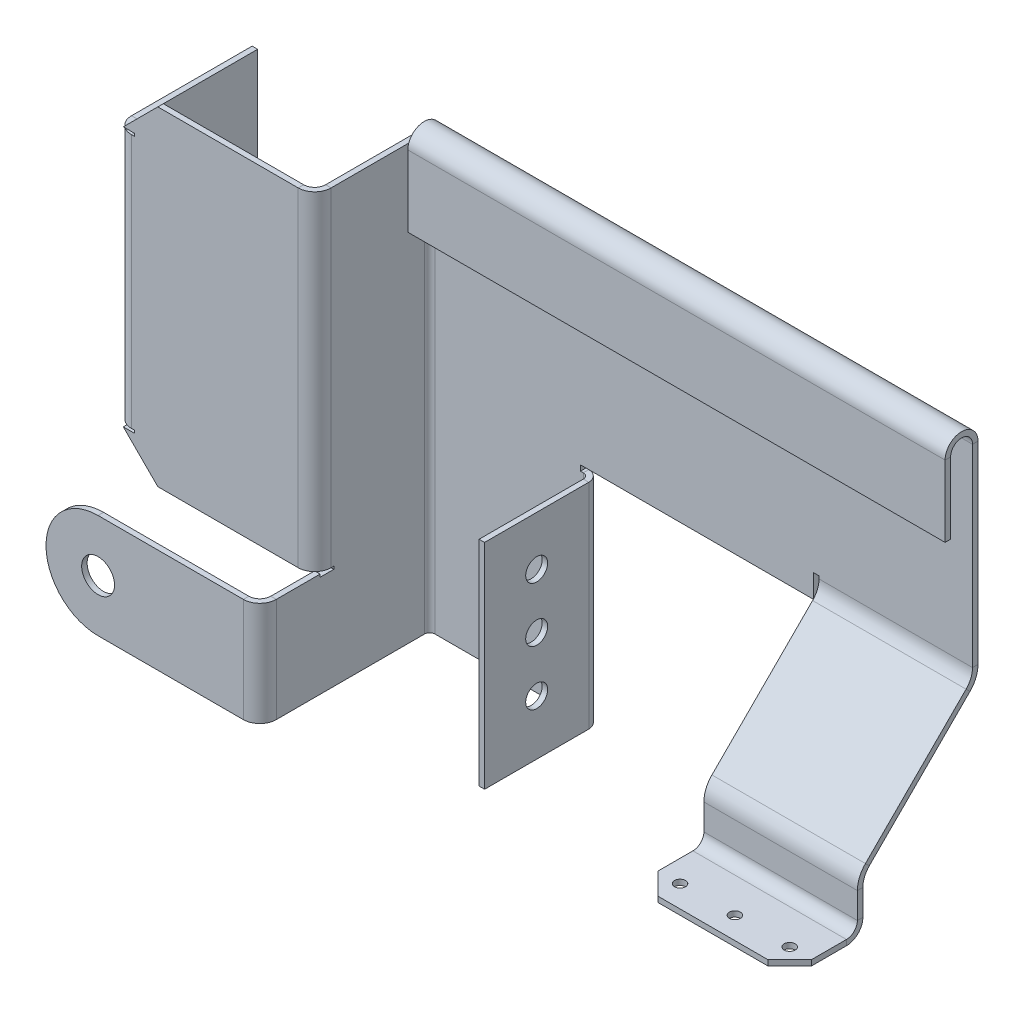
ISO-10303-21;
HEADER;
FILE_DESCRIPTION(('STEP AP214'),'2;1');
FILE_NAME('part.step','',(''),(''),'','','');
FILE_SCHEMA(('AUTOMOTIVE_DESIGN { 1 0 10303 214 1 1 1 1 }'));
ENDSEC;
DATA;
#1=APPLICATION_CONTEXT('core data for automotive mechanical design processes');
#2=APPLICATION_PROTOCOL_DEFINITION('international standard','automotive_design',2000,#1);
#3=PRODUCT_CONTEXT('',#1,'mechanical');
#4=PRODUCT('Part','Part','',(#3));
#5=PRODUCT_RELATED_PRODUCT_CATEGORY('part','',(#4));
#6=PRODUCT_DEFINITION_FORMATION('','',#4);
#7=PRODUCT_DEFINITION_CONTEXT('part definition',#1,'design');
#8=PRODUCT_DEFINITION('design','',#6,#7);
#9=PRODUCT_DEFINITION_SHAPE('','',#8);
#10=(LENGTH_UNIT() NAMED_UNIT(*) SI_UNIT(.MILLI.,.METRE.));
#11=(NAMED_UNIT(*) PLANE_ANGLE_UNIT() SI_UNIT($,.RADIAN.));
#12=(NAMED_UNIT(*) SI_UNIT($,.STERADIAN.) SOLID_ANGLE_UNIT());
#13=UNCERTAINTY_MEASURE_WITH_UNIT(LENGTH_MEASURE(1.E-05),#10,'distance_accuracy_value','');
#14=(GEOMETRIC_REPRESENTATION_CONTEXT(3) GLOBAL_UNCERTAINTY_ASSIGNED_CONTEXT((#13)) GLOBAL_UNIT_ASSIGNED_CONTEXT((#10,
#11,#12)) REPRESENTATION_CONTEXT('',''));
#15=CARTESIAN_POINT('',(0.,0.,0.));
#16=DIRECTION('',(0.,0.,1.));
#17=DIRECTION('',(1.,0.,0.));
#18=AXIS2_PLACEMENT_3D('',#15,#16,#17);
#19=CARTESIAN_POINT('',(-125.,97.5,55.));
#20=DIRECTION('',(0.,0.,-1.));
#21=DIRECTION('',(-1.,0.,0.));
#22=AXIS2_PLACEMENT_3D('',#19,#20,#21);
#23=PLANE('',#22);
#24=DIRECTION('',(-1.,0.,0.));
#25=VECTOR('',#24,1.);
#26=CARTESIAN_POINT('',(-125.,81.75,55.));
#27=LINE('',#26,#25);
#28=CARTESIAN_POINT('',(-204.75,81.75,55.0000000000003));
#29=VERTEX_POINT('',#28);
#30=CARTESIAN_POINT('',(-209.75,81.75,55.0000000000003));
#31=VERTEX_POINT('',#30);
#32=EDGE_CURVE('E528',#29,#31,#27,.T.);
#33=ORIENTED_EDGE('',*,*,#32,.F.);
#34=DIRECTION('',(0.,1.,0.));
#35=VECTOR('',#34,1.);
#36=CARTESIAN_POINT('',(-204.75,97.5,55.0000000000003));
#37=LINE('',#36,#35);
#38=CARTESIAN_POINT('',(-204.75,80.5,55.0000000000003));
#39=VERTEX_POINT('',#38);
#40=EDGE_CURVE('E536',#39,#29,#37,.T.);
#41=ORIENTED_EDGE('',*,*,#40,.F.);
#42=DIRECTION('',(1.,0.,0.));
#43=VECTOR('',#42,1.);
#44=CARTESIAN_POINT('',(-125.,80.5,55.));
#45=LINE('',#44,#43);
#46=CARTESIAN_POINT('',(-206.,80.5,55.0000000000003));
#47=VERTEX_POINT('',#46);
#48=EDGE_CURVE('E534',#47,#39,#45,.T.);
#49=ORIENTED_EDGE('',*,*,#48,.F.);
#50=DIRECTION('',(0.,1.,0.));
#51=VECTOR('',#50,1.);
#52=CARTESIAN_POINT('',(-206.,80.5,55.0000000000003));
#53=LINE('',#52,#51);
#54=CARTESIAN_POINT('',(-206.,-35.5,55.0000000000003));
#55=VERTEX_POINT('',#54);
#56=EDGE_CURVE('E471',#47,#55,#53,.F.);
#57=ORIENTED_EDGE('',*,*,#56,.T.);
#58=DIRECTION('',(-1.,0.,0.));
#59=VECTOR('',#58,1.);
#60=CARTESIAN_POINT('',(-125.,-35.5,55.));
#61=LINE('',#60,#59);
#62=CARTESIAN_POINT('',(-204.75,-35.5,55.0000000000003));
#63=VERTEX_POINT('',#62);
#64=EDGE_CURVE('E532',#63,#55,#61,.T.);
#65=ORIENTED_EDGE('',*,*,#64,.F.);
#66=DIRECTION('',(0.,1.,0.));
#67=VECTOR('',#66,1.);
#68=CARTESIAN_POINT('',(-204.75,97.5,55.0000000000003));
#69=LINE('',#68,#67);
#70=CARTESIAN_POINT('',(-204.75,-36.75,55.0000000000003));
#71=VERTEX_POINT('',#70);
#72=EDGE_CURVE('E530',#71,#63,#69,.T.);
#73=ORIENTED_EDGE('',*,*,#72,.F.);
#74=DIRECTION('',(1.,0.,0.));
#75=VECTOR('',#74,1.);
#76=CARTESIAN_POINT('',(-125.,-36.75,55.));
#77=LINE('',#76,#75);
#78=CARTESIAN_POINT('',(-209.75,-36.75,55.0000000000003));
#79=VERTEX_POINT('',#78);
#80=EDGE_CURVE('E498',#79,#71,#77,.T.);
#81=ORIENTED_EDGE('',*,*,#80,.F.);
#82=DIRECTION('',(-0.707106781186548,0.707106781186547,0.));
#83=VECTOR('',#82,1.);
#84=CARTESIAN_POINT('',(-194.,-52.5,55.0000000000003));
#85=LINE('',#84,#83);
#86=CARTESIAN_POINT('',(-194.,-52.5,55.0000000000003));
#87=VERTEX_POINT('',#86);
#88=EDGE_CURVE('E11',#79,#87,#85,.F.);
#89=ORIENTED_EDGE('',*,*,#88,.T.);
#90=DIRECTION('',(1.,0.,0.));
#91=VECTOR('',#90,1.);
#92=CARTESIAN_POINT('',(-125.,-52.5,55.));
#93=LINE('',#92,#91);
#94=CARTESIAN_POINT('',(-130.,-52.5,55.));
#95=VERTEX_POINT('',#94);
#96=EDGE_CURVE('E553',#87,#95,#93,.T.);
#97=ORIENTED_EDGE('',*,*,#96,.T.);
#98=DIRECTION('',(0.,-1.,0.));
#99=VECTOR('',#98,1.);
#100=CARTESIAN_POINT('',(-130.,97.5,55.));
#101=LINE('',#100,#99);
#102=CARTESIAN_POINT('',(-130.,97.5,55.));
#103=VERTEX_POINT('',#102);
#104=EDGE_CURVE('E544',#103,#95,#101,.T.);
#105=ORIENTED_EDGE('',*,*,#104,.F.);
#106=DIRECTION('',(-1.,0.,0.));
#107=VECTOR('',#106,1.);
#108=CARTESIAN_POINT('',(-211.,97.5,55.0000000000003));
#109=LINE('',#108,#107);
#110=CARTESIAN_POINT('',(-194.,97.5,55.0000000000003));
#111=VERTEX_POINT('',#110);
#112=EDGE_CURVE('E550',#103,#111,#109,.T.);
#113=ORIENTED_EDGE('',*,*,#112,.T.);
#114=DIRECTION('',(0.707106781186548,0.707106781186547,0.));
#115=VECTOR('',#114,1.);
#116=CARTESIAN_POINT('',(-211.,80.5,55.0000000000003));
#117=LINE('',#116,#115);
#118=EDGE_CURVE('E1088',#111,#31,#117,.F.);
#119=ORIENTED_EDGE('',*,*,#118,.T.);
#120=EDGE_LOOP('',(#33,#41,#49,#57,#65,#73,#81,#89,#97,#105,#113,#119));
#121=FACE_BOUND('',#120,.T.);
#122=ADVANCED_FACE('F34',(#121),#23,.F.);
#123=CARTESIAN_POINT('',(-125.,97.5,52.5));
#124=DIRECTION('',(0.,0.,-1.));
#125=DIRECTION('',(-1.,0.,0.));
#126=AXIS2_PLACEMENT_3D('',#123,#124,#125);
#127=PLANE('',#126);
#128=DIRECTION('',(0.,-1.,0.));
#129=VECTOR('',#128,1.);
#130=CARTESIAN_POINT('',(-204.75,81.75,52.5000000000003));
#131=LINE('',#130,#129);
#132=CARTESIAN_POINT('',(-204.75,81.75,52.5000000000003));
#133=VERTEX_POINT('',#132);
#134=CARTESIAN_POINT('',(-204.75,80.5,52.5000000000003));
#135=VERTEX_POINT('',#134);
#136=EDGE_CURVE('E500',#133,#135,#131,.T.);
#137=ORIENTED_EDGE('',*,*,#136,.F.);
#138=DIRECTION('',(1.,0.,0.));
#139=VECTOR('',#138,1.);
#140=CARTESIAN_POINT('',(-209.75,81.75,52.5000000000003));
#141=LINE('',#140,#139);
#142=CARTESIAN_POINT('',(-209.75,81.75,52.5000000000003));
#143=VERTEX_POINT('',#142);
#144=EDGE_CURVE('E495',#143,#133,#141,.T.);
#145=ORIENTED_EDGE('',*,*,#144,.F.);
#146=DIRECTION('',(-0.707106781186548,-0.707106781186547,0.));
#147=VECTOR('',#146,1.);
#148=CARTESIAN_POINT('',(-159.5,132.,52.5000000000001));
#149=LINE('',#148,#147);
#150=CARTESIAN_POINT('',(-194.,97.5,52.5000000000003));
#151=VERTEX_POINT('',#150);
#152=EDGE_CURVE('E1084',#143,#151,#149,.F.);
#153=ORIENTED_EDGE('',*,*,#152,.T.);
#154=DIRECTION('',(-1.,0.,0.));
#155=VECTOR('',#154,1.);
#156=CARTESIAN_POINT('',(-211.,97.5,52.5000000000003));
#157=LINE('',#156,#155);
#158=CARTESIAN_POINT('',(-130.,97.5,52.5));
#159=VERTEX_POINT('',#158);
#160=EDGE_CURVE('E549',#159,#151,#157,.T.);
#161=ORIENTED_EDGE('',*,*,#160,.F.);
#162=DIRECTION('',(0.,1.,0.));
#163=VECTOR('',#162,1.);
#164=CARTESIAN_POINT('',(-130.,-52.5,52.5));
#165=LINE('',#164,#163);
#166=CARTESIAN_POINT('',(-130.,-52.5,52.5));
#167=VERTEX_POINT('',#166);
#168=EDGE_CURVE('E539',#167,#159,#165,.T.);
#169=ORIENTED_EDGE('',*,*,#168,.F.);
#170=DIRECTION('',(1.,0.,0.));
#171=VECTOR('',#170,1.);
#172=CARTESIAN_POINT('',(-125.,-52.5,52.5));
#173=LINE('',#172,#171);
#174=CARTESIAN_POINT('',(-194.,-52.5,52.5000000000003));
#175=VERTEX_POINT('',#174);
#176=EDGE_CURVE('E554',#175,#167,#173,.T.);
#177=ORIENTED_EDGE('',*,*,#176,.F.);
#178=DIRECTION('',(0.707106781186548,-0.707106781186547,0.));
#179=VECTOR('',#178,1.);
#180=CARTESIAN_POINT('',(-234.5,-12.,52.5000000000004));
#181=LINE('',#180,#179);
#182=CARTESIAN_POINT('',(-209.75,-36.75,52.5000000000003));
#183=VERTEX_POINT('',#182);
#184=EDGE_CURVE('E42',#175,#183,#181,.F.);
#185=ORIENTED_EDGE('',*,*,#184,.T.);
#186=DIRECTION('',(-1.,0.,0.));
#187=VECTOR('',#186,1.);
#188=CARTESIAN_POINT('',(-204.75,-36.75,52.5000000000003));
#189=LINE('',#188,#187);
#190=CARTESIAN_POINT('',(-204.75,-36.75,52.5000000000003));
#191=VERTEX_POINT('',#190);
#192=EDGE_CURVE('E49',#191,#183,#189,.T.);
#193=ORIENTED_EDGE('',*,*,#192,.F.);
#194=DIRECTION('',(0.,-1.,0.));
#195=VECTOR('',#194,1.);
#196=CARTESIAN_POINT('',(-204.75,-35.5,52.5000000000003));
#197=LINE('',#196,#195);
#198=CARTESIAN_POINT('',(-204.75,-35.5,52.5000000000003));
#199=VERTEX_POINT('',#198);
#200=EDGE_CURVE('E510',#199,#191,#197,.T.);
#201=ORIENTED_EDGE('',*,*,#200,.F.);
#202=DIRECTION('',(1.,0.,0.));
#203=VECTOR('',#202,1.);
#204=CARTESIAN_POINT('',(-206.,-35.5,52.5000000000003));
#205=LINE('',#204,#203);
#206=CARTESIAN_POINT('',(-206.,-35.5,52.5000000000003));
#207=VERTEX_POINT('',#206);
#208=EDGE_CURVE('E507',#207,#199,#205,.T.);
#209=ORIENTED_EDGE('',*,*,#208,.F.);
#210=DIRECTION('',(0.,1.,0.));
#211=VECTOR('',#210,1.);
#212=CARTESIAN_POINT('',(-206.,80.5,52.5000000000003));
#213=LINE('',#212,#211);
#214=CARTESIAN_POINT('',(-206.,80.5,52.5000000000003));
#215=VERTEX_POINT('',#214);
#216=EDGE_CURVE('E484',#215,#207,#213,.F.);
#217=ORIENTED_EDGE('',*,*,#216,.F.);
#218=DIRECTION('',(-1.,0.,0.));
#219=VECTOR('',#218,1.);
#220=CARTESIAN_POINT('',(-204.75,80.5,52.5000000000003));
#221=LINE('',#220,#219);
#222=EDGE_CURVE('E504',#135,#215,#221,.T.);
#223=ORIENTED_EDGE('',*,*,#222,.F.);
#224=EDGE_LOOP('',(#137,#145,#153,#161,#169,#177,#185,#193,#201,#209,#217,#223));
#225=FACE_BOUND('',#224,.T.);
#226=ADVANCED_FACE('F1095',(#225),#127,.T.);
#227=CARTESIAN_POINT('',(-211.,80.5,55.0000000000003));
#228=DIRECTION('',(0.707106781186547,-0.707106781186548,0.));
#229=DIRECTION('',(0.707106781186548,0.707106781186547,0.));
#230=AXIS2_PLACEMENT_3D('',#227,#228,#229);
#231=PLANE('',#230);
#232=ORIENTED_EDGE('',*,*,#152,.F.);
#233=DIRECTION('',(0.,0.,1.));
#234=VECTOR('',#233,1.);
#235=CARTESIAN_POINT('',(-209.75,81.75,52.5000000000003));
#236=LINE('',#235,#234);
#237=EDGE_CURVE('E499',#143,#31,#236,.T.);
#238=ORIENTED_EDGE('',*,*,#237,.T.);
#239=ORIENTED_EDGE('',*,*,#118,.F.);
#240=DIRECTION('',(0.,0.,1.));
#241=VECTOR('',#240,1.);
#242=CARTESIAN_POINT('',(-194.,97.5,55.0000000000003));
#243=LINE('',#242,#241);
#244=EDGE_CURVE('E1086',#151,#111,#243,.T.);
#245=ORIENTED_EDGE('',*,*,#244,.F.);
#246=EDGE_LOOP('',(#232,#238,#239,#245));
#247=FACE_BOUND('',#246,.T.);
#248=ADVANCED_FACE('F1183',(#247),#231,.F.);
#249=CARTESIAN_POINT('',(-194.,-52.5,55.0000000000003));
#250=DIRECTION('',(0.707106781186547,0.707106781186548,0.));
#251=DIRECTION('',(-0.707106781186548,0.707106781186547,0.));
#252=AXIS2_PLACEMENT_3D('',#249,#250,#251);
#253=PLANE('',#252);
#254=ORIENTED_EDGE('',*,*,#88,.F.);
#255=DIRECTION('',(0.,0.,1.));
#256=VECTOR('',#255,1.);
#257=CARTESIAN_POINT('',(-209.75,-36.75,52.5000000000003));
#258=LINE('',#257,#256);
#259=EDGE_CURVE('E515',#183,#79,#258,.T.);
#260=ORIENTED_EDGE('',*,*,#259,.F.);
#261=ORIENTED_EDGE('',*,*,#184,.F.);
#262=DIRECTION('',(0.,0.,-1.));
#263=VECTOR('',#262,1.);
#264=CARTESIAN_POINT('',(-194.,-52.5,55.0000000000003));
#265=LINE('',#264,#263);
#266=EDGE_CURVE('E1091',#87,#175,#265,.T.);
#267=ORIENTED_EDGE('',*,*,#266,.F.);
#268=EDGE_LOOP('',(#254,#260,#261,#267));
#269=FACE_BOUND('',#268,.T.);
#270=ADVANCED_FACE('F36',(#269),#253,.F.);
#271=CARTESIAN_POINT('',(294.932629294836,97.5,0.));
#272=DIRECTION('',(0.,1.,0.));
#273=DIRECTION('',(1.,0.,0.));
#274=AXIS2_PLACEMENT_3D('',#271,#272,#273);
#275=PLANE('',#274);
#276=DIRECTION('',(0.,0.,1.));
#277=VECTOR('',#276,1.);
#278=CARTESIAN_POINT('',(-125.,97.5,0.));
#279=LINE('',#278,#277);
#280=CARTESIAN_POINT('',(-125.,97.5,5.));
#281=VERTEX_POINT('',#280);
#282=CARTESIAN_POINT('',(-125.,97.5,47.5));
#283=VERTEX_POINT('',#282);
#284=EDGE_CURVE('E852',#281,#283,#279,.T.);
#285=ORIENTED_EDGE('',*,*,#284,.T.);
#286=DIRECTION('',(1.,0.,0.));
#287=VECTOR('',#286,1.);
#288=CARTESIAN_POINT('',(-125.,97.5,47.5));
#289=LINE('',#288,#287);
#290=CARTESIAN_POINT('',(-122.5,97.5,47.5));
#291=VERTEX_POINT('',#290);
#292=EDGE_CURVE('E567',#283,#291,#289,.T.);
#293=ORIENTED_EDGE('',*,*,#292,.T.);
#294=DIRECTION('',(0.,0.,1.));
#295=VECTOR('',#294,1.);
#296=CARTESIAN_POINT('',(-122.5,97.5,0.));
#297=LINE('',#296,#295);
#298=CARTESIAN_POINT('',(-122.5,97.5,5.));
#299=VERTEX_POINT('',#298);
#300=EDGE_CURVE('E850',#291,#299,#297,.F.);
#301=ORIENTED_EDGE('',*,*,#300,.T.);
#302=DIRECTION('',(-1.,0.,0.));
#303=VECTOR('',#302,1.);
#304=CARTESIAN_POINT('',(294.932629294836,97.5,5.));
#305=LINE('',#304,#303);
#306=EDGE_CURVE('E848',#299,#281,#305,.T.);
#307=ORIENTED_EDGE('',*,*,#306,.T.);
#308=EDGE_LOOP('',(#285,#293,#301,#307));
#309=FACE_BOUND('',#308,.T.);
#310=ADVANCED_FACE('F1117',(#309),#275,.T.);
#311=CARTESIAN_POINT('',(-125.,-1.25,27.5));
#312=DIRECTION('',(1.,0.,0.));
#313=DIRECTION('',(0.,0.,-1.));
#314=AXIS2_PLACEMENT_3D('',#311,#312,#313);
#315=PLANE('',#314);
#316=DIRECTION('',(0.,1.,0.));
#317=VECTOR('',#316,1.);
#318=CARTESIAN_POINT('',(-125.,97.5,47.5));
#319=LINE('',#318,#317);
#320=CARTESIAN_POINT('',(-125.,-52.5,47.5));
#321=VERTEX_POINT('',#320);
#322=EDGE_CURVE('E573',#283,#321,#319,.F.);
#323=ORIENTED_EDGE('',*,*,#322,.F.);
#324=ORIENTED_EDGE('',*,*,#284,.F.);
#325=DIRECTION('',(0.,1.,0.));
#326=VECTOR('',#325,1.);
#327=CARTESIAN_POINT('',(-125.,-1.25,5.));
#328=LINE('',#327,#326);
#329=CARTESIAN_POINT('',(-125.,-100.,5.));
#330=VERTEX_POINT('',#329);
#331=EDGE_CURVE('E796',#330,#281,#328,.T.);
#332=ORIENTED_EDGE('',*,*,#331,.F.);
#333=DIRECTION('',(0.,0.,-1.));
#334=VECTOR('',#333,1.);
#335=CARTESIAN_POINT('',(-125.,-100.,0.));
#336=LINE('',#335,#334);
#337=CARTESIAN_POINT('',(-125.,-100.,72.5));
#338=VERTEX_POINT('',#337);
#339=EDGE_CURVE('E863',#338,#330,#336,.T.);
#340=ORIENTED_EDGE('',*,*,#339,.F.);
#341=DIRECTION('',(0.,1.,0.));
#342=VECTOR('',#341,1.);
#343=CARTESIAN_POINT('',(-125.,-1.25,72.5));
#344=LINE('',#343,#342);
#345=CARTESIAN_POINT('',(-125.,-52.5,72.5));
#346=VERTEX_POINT('',#345);
#347=EDGE_CURVE('E896',#346,#338,#344,.F.);
#348=ORIENTED_EDGE('',*,*,#347,.F.);
#349=DIRECTION('',(0.,0.,-1.));
#350=VECTOR('',#349,1.);
#351=CARTESIAN_POINT('',(-125.,-52.5,27.5));
#352=LINE('',#351,#350);
#353=CARTESIAN_POINT('',(-125.,-52.5,52.5));
#354=VERTEX_POINT('',#353);
#355=EDGE_CURVE('E866',#354,#346,#352,.F.);
#356=ORIENTED_EDGE('',*,*,#355,.F.);
#357=DIRECTION('',(0.,1.,0.));
#358=VECTOR('',#357,1.);
#359=CARTESIAN_POINT('',(-125.,-53.75,52.5));
#360=LINE('',#359,#358);
#361=CARTESIAN_POINT('',(-125.,-53.75,52.5));
#362=VERTEX_POINT('',#361);
#363=EDGE_CURVE('E595',#362,#354,#360,.T.);
#364=ORIENTED_EDGE('',*,*,#363,.F.);
#365=DIRECTION('',(0.,0.,1.));
#366=VECTOR('',#365,1.);
#367=CARTESIAN_POINT('',(-125.,-53.75,46.25));
#368=LINE('',#367,#366);
#369=CARTESIAN_POINT('',(-125.,-53.75,46.25));
#370=VERTEX_POINT('',#369);
#371=EDGE_CURVE('E591',#370,#362,#368,.T.);
#372=ORIENTED_EDGE('',*,*,#371,.F.);
#373=DIRECTION('',(0.,-1.,0.));
#374=VECTOR('',#373,1.);
#375=CARTESIAN_POINT('',(-125.,-52.5,46.25));
#376=LINE('',#375,#374);
#377=CARTESIAN_POINT('',(-125.,-52.5,46.25));
#378=VERTEX_POINT('',#377);
#379=EDGE_CURVE('E587',#378,#370,#376,.T.);
#380=ORIENTED_EDGE('',*,*,#379,.F.);
#381=DIRECTION('',(0.,0.,-1.));
#382=VECTOR('',#381,1.);
#383=CARTESIAN_POINT('',(-125.,-52.5,47.5));
#384=LINE('',#383,#382);
#385=EDGE_CURVE('E583',#321,#378,#384,.T.);
#386=ORIENTED_EDGE('',*,*,#385,.F.);
#387=EDGE_LOOP('',(#323,#324,#332,#340,#348,#356,#364,#372,#380,#386));
#388=FACE_BOUND('',#387,.T.);
#389=ADVANCED_FACE('F1114',(#388),#315,.F.);
#390=CARTESIAN_POINT('',(-122.5,-1.25,27.5));
#391=DIRECTION('',(1.,0.,0.));
#392=DIRECTION('',(0.,0.,-1.));
#393=AXIS2_PLACEMENT_3D('',#390,#391,#392);
#394=PLANE('',#393);
#395=ORIENTED_EDGE('',*,*,#300,.F.);
#396=DIRECTION('',(0.,1.,0.));
#397=VECTOR('',#396,1.);
#398=CARTESIAN_POINT('',(-122.5,97.5,47.5));
#399=LINE('',#398,#397);
#400=CARTESIAN_POINT('',(-122.5,-52.5,47.5));
#401=VERTEX_POINT('',#400);
#402=EDGE_CURVE('E560',#291,#401,#399,.F.);
#403=ORIENTED_EDGE('',*,*,#402,.T.);
#404=DIRECTION('',(0.,0.,-1.));
#405=VECTOR('',#404,1.);
#406=CARTESIAN_POINT('',(-122.5,-52.5,27.5));
#407=LINE('',#406,#405);
#408=CARTESIAN_POINT('',(-122.5,-52.5,46.25));
#409=VERTEX_POINT('',#408);
#410=EDGE_CURVE('E1081',#401,#409,#407,.T.);
#411=ORIENTED_EDGE('',*,*,#410,.T.);
#412=DIRECTION('',(0.,-1.,0.));
#413=VECTOR('',#412,1.);
#414=CARTESIAN_POINT('',(-122.5,-1.25,46.25));
#415=LINE('',#414,#413);
#416=CARTESIAN_POINT('',(-122.5,-53.75,46.25));
#417=VERTEX_POINT('',#416);
#418=EDGE_CURVE('E1078',#409,#417,#415,.T.);
#419=ORIENTED_EDGE('',*,*,#418,.T.);
#420=DIRECTION('',(0.,0.,1.));
#421=VECTOR('',#420,1.);
#422=CARTESIAN_POINT('',(-122.5,-53.75,27.5));
#423=LINE('',#422,#421);
#424=CARTESIAN_POINT('',(-122.5,-53.75,52.5));
#425=VERTEX_POINT('',#424);
#426=EDGE_CURVE('E1075',#417,#425,#423,.T.);
#427=ORIENTED_EDGE('',*,*,#426,.T.);
#428=DIRECTION('',(0.,1.,0.));
#429=VECTOR('',#428,1.);
#430=CARTESIAN_POINT('',(-122.5,-1.25,52.5));
#431=LINE('',#430,#429);
#432=CARTESIAN_POINT('',(-122.5,-52.5,52.5));
#433=VERTEX_POINT('',#432);
#434=EDGE_CURVE('E1014',#425,#433,#431,.T.);
#435=ORIENTED_EDGE('',*,*,#434,.T.);
#436=DIRECTION('',(0.,0.,-1.));
#437=VECTOR('',#436,1.);
#438=CARTESIAN_POINT('',(-122.5,-52.5,27.5));
#439=LINE('',#438,#437);
#440=CARTESIAN_POINT('',(-122.5,-52.5,72.5));
#441=VERTEX_POINT('',#440);
#442=EDGE_CURVE('E811',#433,#441,#439,.F.);
#443=ORIENTED_EDGE('',*,*,#442,.T.);
#444=DIRECTION('',(0.,1.,0.));
#445=VECTOR('',#444,1.);
#446=CARTESIAN_POINT('',(-122.5,-76.25,72.5));
#447=LINE('',#446,#445);
#448=CARTESIAN_POINT('',(-122.5,-100.,72.5));
#449=VERTEX_POINT('',#448);
#450=EDGE_CURVE('E855',#449,#441,#447,.T.);
#451=ORIENTED_EDGE('',*,*,#450,.F.);
#452=DIRECTION('',(0.,0.,-1.));
#453=VECTOR('',#452,1.);
#454=CARTESIAN_POINT('',(-122.5,-100.,0.));
#455=LINE('',#454,#453);
#456=CARTESIAN_POINT('',(-122.5,-100.,5.));
#457=VERTEX_POINT('',#456);
#458=EDGE_CURVE('E860',#457,#449,#455,.F.);
#459=ORIENTED_EDGE('',*,*,#458,.F.);
#460=DIRECTION('',(0.,1.,0.));
#461=VECTOR('',#460,1.);
#462=CARTESIAN_POINT('',(-122.5,-1.25,5.));
#463=LINE('',#462,#461);
#464=EDGE_CURVE('E814',#457,#299,#463,.T.);
#465=ORIENTED_EDGE('',*,*,#464,.T.);
#466=EDGE_LOOP('',(#395,#403,#411,#419,#427,#435,#443,#451,#459,#465));
#467=FACE_BOUND('',#466,.T.);
#468=ADVANCED_FACE('F1547',(#467),#394,.T.);
#469=CARTESIAN_POINT('',(90.,-71.8132010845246,75.8693218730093));
#470=DIRECTION('',(0.,1.,0.));
#471=DIRECTION('',(1.,0.,0.));
#472=AXIS2_PLACEMENT_3D('',#469,#470,#471);
#473=CYLINDRICAL_SURFACE('',#472,2.5);
#474=CARTESIAN_POINT('',(90.,-69.3132010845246,75.8693218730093));
#475=DIRECTION('',(0.,1.,0.));
#476=DIRECTION('',(1.,0.,0.));
#477=AXIS2_PLACEMENT_3D('',#474,#475,#476);
#478=CIRCLE('',#477,2.5);
#479=CARTESIAN_POINT('',(92.5,-69.3132010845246,75.8693218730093));
#480=VERTEX_POINT('',#479);
#481=EDGE_CURVE('E1029',#480,#480,#478,.F.);
#482=ORIENTED_EDGE('',*,*,#481,.F.);
#483=EDGE_LOOP('',(#482));
#484=FACE_BOUND('',#483,.T.);
#485=CARTESIAN_POINT('',(90.,-71.8132010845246,75.8693218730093));
#486=DIRECTION('',(0.,1.,0.));
#487=DIRECTION('',(1.,0.,0.));
#488=AXIS2_PLACEMENT_3D('',#485,#486,#487);
#489=CIRCLE('',#488,2.5);
#490=CARTESIAN_POINT('',(92.5,-71.8132010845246,75.8693218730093));
#491=VERTEX_POINT('',#490);
#492=EDGE_CURVE('E1068',#491,#491,#489,.F.);
#493=ORIENTED_EDGE('',*,*,#492,.T.);
#494=EDGE_LOOP('',(#493));
#495=FACE_BOUND('',#494,.T.);
#496=ADVANCED_FACE('F1556',(#484,#495),#473,.F.);
#497=CARTESIAN_POINT('',(65.,-71.8132010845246,75.8693218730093));
#498=DIRECTION('',(0.,1.,0.));
#499=DIRECTION('',(1.,0.,0.));
#500=AXIS2_PLACEMENT_3D('',#497,#498,#499);
#501=CYLINDRICAL_SURFACE('',#500,2.5);
#502=CARTESIAN_POINT('',(65.,-69.3132010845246,75.8693218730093));
#503=DIRECTION('',(0.,1.,0.));
#504=DIRECTION('',(1.,0.,0.));
#505=AXIS2_PLACEMENT_3D('',#502,#503,#504);
#506=CIRCLE('',#505,2.5);
#507=CARTESIAN_POINT('',(67.5,-69.3132010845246,75.8693218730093));
#508=VERTEX_POINT('',#507);
#509=EDGE_CURVE('E1026',#508,#508,#506,.F.);
#510=ORIENTED_EDGE('',*,*,#509,.F.);
#511=EDGE_LOOP('',(#510));
#512=FACE_BOUND('',#511,.T.);
#513=CARTESIAN_POINT('',(65.,-71.8132010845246,75.8693218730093));
#514=DIRECTION('',(0.,1.,0.));
#515=DIRECTION('',(1.,0.,0.));
#516=AXIS2_PLACEMENT_3D('',#513,#514,#515);
#517=CIRCLE('',#516,2.5);
#518=CARTESIAN_POINT('',(67.5,-71.8132010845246,75.8693218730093));
#519=VERTEX_POINT('',#518);
#520=EDGE_CURVE('E1065',#519,#519,#517,.F.);
#521=ORIENTED_EDGE('',*,*,#520,.T.);
#522=EDGE_LOOP('',(#521));
#523=FACE_BOUND('',#522,.T.);
#524=ADVANCED_FACE('F2256',(#512,#523),#501,.F.);
#525=CARTESIAN_POINT('',(115.,-71.8132010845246,75.8693218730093));
#526=DIRECTION('',(0.,1.,0.));
#527=DIRECTION('',(1.,0.,0.));
#528=AXIS2_PLACEMENT_3D('',#525,#526,#527);
#529=CYLINDRICAL_SURFACE('',#528,2.5);
#530=CARTESIAN_POINT('',(115.,-69.3132010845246,75.8693218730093));
#531=DIRECTION('',(0.,1.,0.));
#532=DIRECTION('',(1.,0.,0.));
#533=AXIS2_PLACEMENT_3D('',#530,#531,#532);
#534=CIRCLE('',#533,2.5);
#535=CARTESIAN_POINT('',(117.5,-69.3132010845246,75.8693218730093));
#536=VERTEX_POINT('',#535);
#537=EDGE_CURVE('E1023',#536,#536,#534,.F.);
#538=ORIENTED_EDGE('',*,*,#537,.F.);
#539=EDGE_LOOP('',(#538));
#540=FACE_BOUND('',#539,.T.);
#541=CARTESIAN_POINT('',(115.,-71.8132010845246,75.8693218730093));
#542=DIRECTION('',(0.,1.,0.));
#543=DIRECTION('',(1.,0.,0.));
#544=AXIS2_PLACEMENT_3D('',#541,#542,#543);
#545=CIRCLE('',#544,2.5);
#546=CARTESIAN_POINT('',(117.5,-71.8132010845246,75.8693218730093));
#547=VERTEX_POINT('',#546);
#548=EDGE_CURVE('E1062',#547,#547,#545,.F.);
#549=ORIENTED_EDGE('',*,*,#548,.T.);
#550=EDGE_LOOP('',(#549));
#551=FACE_BOUND('',#550,.T.);
#552=ADVANCED_FACE('F2246',(#540,#551),#529,.F.);
#553=CARTESIAN_POINT('',(90.,-238.502444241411,85.8693218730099));
#554=DIRECTION('',(0.,0.,1.));
#555=DIRECTION('',(0.,-1.,0.));
#556=AXIS2_PLACEMENT_3D('',#553,#554,#555);
#557=PLANE('',#556);
#558=DIRECTION('',(0.,1.,0.));
#559=VECTOR('',#558,1.);
#560=CARTESIAN_POINT('',(115.,-238.502444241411,85.8693218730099));
#561=LINE('',#560,#559);
#562=CARTESIAN_POINT('',(115.,-71.8132010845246,85.8693218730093));
#563=VERTEX_POINT('',#562);
#564=CARTESIAN_POINT('',(115.,-69.3132010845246,85.8693218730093));
#565=VERTEX_POINT('',#564);
#566=EDGE_CURVE('E1059',#563,#565,#561,.T.);
#567=ORIENTED_EDGE('',*,*,#566,.T.);
#568=DIRECTION('',(1.,0.,0.));
#569=VECTOR('',#568,1.);
#570=CARTESIAN_POINT('',(90.,-69.3132010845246,85.8693218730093));
#571=LINE('',#570,#569);
#572=CARTESIAN_POINT('',(65.,-69.3132010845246,85.8693218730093));
#573=VERTEX_POINT('',#572);
#574=EDGE_CURVE('E1015',#573,#565,#571,.T.);
#575=ORIENTED_EDGE('',*,*,#574,.F.);
#576=DIRECTION('',(0.,1.,0.));
#577=VECTOR('',#576,1.);
#578=CARTESIAN_POINT('',(65.,-238.502444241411,85.8693218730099));
#579=LINE('',#578,#577);
#580=CARTESIAN_POINT('',(65.,-71.8132010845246,85.8693218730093));
#581=VERTEX_POINT('',#580);
#582=EDGE_CURVE('E1049',#581,#573,#579,.T.);
#583=ORIENTED_EDGE('',*,*,#582,.F.);
#584=DIRECTION('',(1.,0.,0.));
#585=VECTOR('',#584,1.);
#586=CARTESIAN_POINT('',(90.,-71.8132010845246,85.8693218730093));
#587=LINE('',#586,#585);
#588=EDGE_CURVE('E1057',#581,#563,#587,.T.);
#589=ORIENTED_EDGE('',*,*,#588,.T.);
#590=EDGE_LOOP('',(#567,#575,#583,#589));
#591=FACE_BOUND('',#590,.T.);
#592=ADVANCED_FACE('F2236',(#591),#557,.T.);
#593=CARTESIAN_POINT('',(115.,-238.502444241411,85.8693218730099));
#594=DIRECTION('',(0.707106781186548,0.,0.707106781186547));
#595=DIRECTION('',(0.707106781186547,0.,-0.707106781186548));
#596=AXIS2_PLACEMENT_3D('',#593,#594,#595);
#597=PLANE('',#596);
#598=DIRECTION('',(0.,1.,0.));
#599=VECTOR('',#598,1.);
#600=CARTESIAN_POINT('',(125.,-238.502444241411,75.8693218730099));
#601=LINE('',#600,#599);
#602=CARTESIAN_POINT('',(125.,-71.8132010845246,75.8693218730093));
#603=VERTEX_POINT('',#602);
#604=CARTESIAN_POINT('',(125.,-69.3132010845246,75.8693218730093));
#605=VERTEX_POINT('',#604);
#606=EDGE_CURVE('E1054',#603,#605,#601,.T.);
#607=ORIENTED_EDGE('',*,*,#606,.T.);
#608=DIRECTION('',(0.707106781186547,0.,-0.707106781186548));
#609=VECTOR('',#608,1.);
#610=CARTESIAN_POINT('',(115.,-69.3132010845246,85.8693218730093));
#611=LINE('',#610,#609);
#612=EDGE_CURVE('E1011',#565,#605,#611,.T.);
#613=ORIENTED_EDGE('',*,*,#612,.F.);
#614=ORIENTED_EDGE('',*,*,#566,.F.);
#615=DIRECTION('',(0.707106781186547,0.,-0.707106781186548));
#616=VECTOR('',#615,1.);
#617=CARTESIAN_POINT('',(115.,-71.8132010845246,85.8693218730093));
#618=LINE('',#617,#616);
#619=EDGE_CURVE('E1052',#563,#603,#618,.T.);
#620=ORIENTED_EDGE('',*,*,#619,.T.);
#621=EDGE_LOOP('',(#607,#613,#614,#620));
#622=FACE_BOUND('',#621,.T.);
#623=ADVANCED_FACE('F2226',(#622),#597,.T.);
#624=CARTESIAN_POINT('',(55.,-238.502444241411,75.8693218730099));
#625=DIRECTION('',(-0.707106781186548,0.,0.707106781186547));
#626=DIRECTION('',(0.707106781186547,0.,0.707106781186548));
#627=AXIS2_PLACEMENT_3D('',#624,#625,#626);
#628=PLANE('',#627);
#629=ORIENTED_EDGE('',*,*,#582,.T.);
#630=DIRECTION('',(0.707106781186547,0.,0.707106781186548));
#631=VECTOR('',#630,1.);
#632=CARTESIAN_POINT('',(55.,-69.3132010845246,75.8693218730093));
#633=LINE('',#632,#631);
#634=CARTESIAN_POINT('',(55.,-69.3132010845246,75.8693218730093));
#635=VERTEX_POINT('',#634);
#636=EDGE_CURVE('E1017',#635,#573,#633,.T.);
#637=ORIENTED_EDGE('',*,*,#636,.F.);
#638=DIRECTION('',(0.,1.,0.));
#639=VECTOR('',#638,1.);
#640=CARTESIAN_POINT('',(55.,-238.502444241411,75.8693218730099));
#641=LINE('',#640,#639);
#642=CARTESIAN_POINT('',(55.,-71.8132010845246,75.8693218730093));
#643=VERTEX_POINT('',#642);
#644=EDGE_CURVE('E1039',#643,#635,#641,.T.);
#645=ORIENTED_EDGE('',*,*,#644,.F.);
#646=DIRECTION('',(0.707106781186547,0.,0.707106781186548));
#647=VECTOR('',#646,1.);
#648=CARTESIAN_POINT('',(55.,-71.8132010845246,75.8693218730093));
#649=LINE('',#648,#647);
#650=EDGE_CURVE('E1047',#643,#581,#649,.T.);
#651=ORIENTED_EDGE('',*,*,#650,.T.);
#652=EDGE_LOOP('',(#629,#637,#645,#651));
#653=FACE_BOUND('',#652,.T.);
#654=ADVANCED_FACE('F2216',(#653),#628,.T.);
#655=CARTESIAN_POINT('',(55.,-238.502444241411,62.1193218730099));
#656=DIRECTION('',(-1.,0.,0.));
#657=DIRECTION('',(0.,1.,0.));
#658=AXIS2_PLACEMENT_3D('',#655,#656,#657);
#659=PLANE('',#658);
#660=DIRECTION('',(0.,0.,-1.));
#661=VECTOR('',#660,1.);
#662=CARTESIAN_POINT('',(55.,-69.3132010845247,62.1193218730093));
#663=LINE('',#662,#661);
#664=CARTESIAN_POINT('',(55.,-69.3132010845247,60.000000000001));
#665=VERTEX_POINT('',#664);
#666=EDGE_CURVE('E1019',#665,#635,#663,.F.);
#667=ORIENTED_EDGE('',*,*,#666,.F.);
#668=DIRECTION('',(0.,-1.,0.));
#669=VECTOR('',#668,1.);
#670=CARTESIAN_POINT('',(55.,-238.502444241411,60.0000000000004));
#671=LINE('',#670,#669);
#672=CARTESIAN_POINT('',(55.,-71.8132010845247,60.0000000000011));
#673=VERTEX_POINT('',#672);
#674=EDGE_CURVE('E1044',#665,#673,#671,.T.);
#675=ORIENTED_EDGE('',*,*,#674,.T.);
#676=DIRECTION('',(0.,0.,-1.));
#677=VECTOR('',#676,1.);
#678=CARTESIAN_POINT('',(55.,-71.8132010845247,62.1193218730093));
#679=LINE('',#678,#677);
#680=EDGE_CURVE('E1042',#673,#643,#679,.F.);
#681=ORIENTED_EDGE('',*,*,#680,.T.);
#682=ORIENTED_EDGE('',*,*,#644,.T.);
#683=EDGE_LOOP('',(#667,#675,#681,#682));
#684=FACE_BOUND('',#683,.T.);
#685=ADVANCED_FACE('F2206',(#684),#659,.T.);
#686=CARTESIAN_POINT('',(90.,-71.8132010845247,62.1193218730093));
#687=DIRECTION('',(0.,1.,0.));
#688=DIRECTION('',(1.,0.,0.));
#689=AXIS2_PLACEMENT_3D('',#686,#687,#688);
#690=PLANE('',#689);
#691=DIRECTION('',(-1.,0.,0.));
#692=VECTOR('',#691,1.);
#693=CARTESIAN_POINT('',(90.,-71.8132010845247,60.0000000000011));
#694=LINE('',#693,#692);
#695=CARTESIAN_POINT('',(125.,-71.8132010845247,60.0000000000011));
#696=VERTEX_POINT('',#695);
#697=EDGE_CURVE('E979',#696,#673,#694,.T.);
#698=ORIENTED_EDGE('',*,*,#697,.F.);
#699=DIRECTION('',(0.,0.,-1.));
#700=VECTOR('',#699,1.);
#701=CARTESIAN_POINT('',(125.,-71.8132010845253,-111.630678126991));
#702=LINE('',#701,#700);
#703=EDGE_CURVE('E1036',#603,#696,#702,.T.);
#704=ORIENTED_EDGE('',*,*,#703,.F.);
#705=ORIENTED_EDGE('',*,*,#619,.F.);
#706=ORIENTED_EDGE('',*,*,#588,.F.);
#707=ORIENTED_EDGE('',*,*,#650,.F.);
#708=ORIENTED_EDGE('',*,*,#680,.F.);
#709=EDGE_LOOP('',(#698,#704,#705,#706,#707,#708));
#710=FACE_BOUND('',#709,.T.);
#711=ORIENTED_EDGE('',*,*,#548,.F.);
#712=EDGE_LOOP('',(#711));
#713=FACE_BOUND('',#712,.T.);
#714=ORIENTED_EDGE('',*,*,#520,.F.);
#715=EDGE_LOOP('',(#714));
#716=FACE_BOUND('',#715,.T.);
#717=ORIENTED_EDGE('',*,*,#492,.F.);
#718=EDGE_LOOP('',(#717));
#719=FACE_BOUND('',#718,.T.);
#720=ADVANCED_FACE('F2196',(#710,#713,#716,#719),#690,.F.);
#721=CARTESIAN_POINT('',(125.,-238.502444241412,-111.63067812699));
#722=DIRECTION('',(1.,0.,0.));
#723=DIRECTION('',(0.,-1.,0.));
#724=AXIS2_PLACEMENT_3D('',#721,#722,#723);
#725=PLANE('',#724);
#726=ORIENTED_EDGE('',*,*,#703,.T.);
#727=DIRECTION('',(0.,1.,0.));
#728=VECTOR('',#727,1.);
#729=CARTESIAN_POINT('',(125.,-238.502444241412,60.0000000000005));
#730=LINE('',#729,#728);
#731=CARTESIAN_POINT('',(125.,-69.3132010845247,60.000000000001));
#732=VERTEX_POINT('',#731);
#733=EDGE_CURVE('E1034',#696,#732,#730,.T.);
#734=ORIENTED_EDGE('',*,*,#733,.T.);
#735=DIRECTION('',(0.,0.,-1.));
#736=VECTOR('',#735,1.);
#737=CARTESIAN_POINT('',(125.,-69.3132010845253,-111.630678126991));
#738=LINE('',#737,#736);
#739=EDGE_CURVE('E1032',#732,#605,#738,.F.);
#740=ORIENTED_EDGE('',*,*,#739,.T.);
#741=ORIENTED_EDGE('',*,*,#606,.F.);
#742=EDGE_LOOP('',(#726,#734,#740,#741));
#743=FACE_BOUND('',#742,.T.);
#744=ADVANCED_FACE('F2187',(#743),#725,.T.);
#745=CARTESIAN_POINT('',(90.,-69.3132010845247,62.1193218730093));
#746=DIRECTION('',(0.,1.,0.));
#747=DIRECTION('',(1.,0.,0.));
#748=AXIS2_PLACEMENT_3D('',#745,#746,#747);
#749=PLANE('',#748);
#750=ORIENTED_EDGE('',*,*,#481,.T.);
#751=EDGE_LOOP('',(#750));
#752=FACE_BOUND('',#751,.T.);
#753=ORIENTED_EDGE('',*,*,#509,.T.);
#754=EDGE_LOOP('',(#753));
#755=FACE_BOUND('',#754,.T.);
#756=ORIENTED_EDGE('',*,*,#537,.T.);
#757=EDGE_LOOP('',(#756));
#758=FACE_BOUND('',#757,.T.);
#759=ORIENTED_EDGE('',*,*,#739,.F.);
#760=DIRECTION('',(-1.,0.,0.));
#761=VECTOR('',#760,1.);
#762=CARTESIAN_POINT('',(90.,-69.3132010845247,60.0000000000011));
#763=LINE('',#762,#761);
#764=EDGE_CURVE('E1021',#732,#665,#763,.T.);
#765=ORIENTED_EDGE('',*,*,#764,.T.);
#766=ORIENTED_EDGE('',*,*,#666,.T.);
#767=ORIENTED_EDGE('',*,*,#636,.T.);
#768=ORIENTED_EDGE('',*,*,#574,.T.);
#769=ORIENTED_EDGE('',*,*,#612,.T.);
#770=EDGE_LOOP('',(#759,#765,#766,#767,#768,#769));
#771=FACE_BOUND('',#770,.T.);
#772=ADVANCED_FACE('F2177',(#752,#755,#758,#771),#749,.T.);
#773=CARTESIAN_POINT('',(125.,97.4999999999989,-114.189243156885));
#774=DIRECTION('',(1.,0.,0.));
#775=DIRECTION('',(0.,0.,-1.));
#776=AXIS2_PLACEMENT_3D('',#773,#774,#775);
#777=PLANE('',#776);
#778=DIRECTION('',(0.,0.,1.));
#779=VECTOR('',#778,1.);
#780=CARTESIAN_POINT('',(125.,-64.3132010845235,-114.189243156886));
#781=LINE('',#780,#779);
#782=CARTESIAN_POINT('',(125.,-64.3132010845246,52.5000000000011));
#783=VERTEX_POINT('',#782);
#784=CARTESIAN_POINT('',(125.,-64.3132010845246,55.0000000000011));
#785=VERTEX_POINT('',#784);
#786=EDGE_CURVE('E990',#783,#785,#781,.T.);
#787=ORIENTED_EDGE('',*,*,#786,.F.);
#788=DIRECTION('',(0.,1.,0.));
#789=VECTOR('',#788,1.);
#790=CARTESIAN_POINT('',(125.,97.4999999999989,52.5000000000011));
#791=LINE('',#790,#789);
#792=CARTESIAN_POINT('',(125.,-52.5000000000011,52.5000000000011));
#793=VERTEX_POINT('',#792);
#794=EDGE_CURVE('E989',#783,#793,#791,.T.);
#795=ORIENTED_EDGE('',*,*,#794,.T.);
#796=DIRECTION('',(0.,0.,1.));
#797=VECTOR('',#796,1.);
#798=CARTESIAN_POINT('',(125.,-52.500000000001,-114.189243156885));
#799=LINE('',#798,#797);
#800=CARTESIAN_POINT('',(125.,-52.5000000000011,55.0000000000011));
#801=VERTEX_POINT('',#800);
#802=EDGE_CURVE('E986',#793,#801,#799,.T.);
#803=ORIENTED_EDGE('',*,*,#802,.T.);
#804=DIRECTION('',(0.,1.,0.));
#805=VECTOR('',#804,1.);
#806=CARTESIAN_POINT('',(125.,97.4999999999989,55.0000000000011));
#807=LINE('',#806,#805);
#808=EDGE_CURVE('E985',#801,#785,#807,.F.);
#809=ORIENTED_EDGE('',*,*,#808,.T.);
#810=EDGE_LOOP('',(#787,#795,#803,#809));
#811=FACE_BOUND('',#810,.T.);
#812=ADVANCED_FACE('F2167',(#811),#777,.T.);
#813=CARTESIAN_POINT('',(90.,-76.2500000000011,55.0000000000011));
#814=DIRECTION('',(0.,0.,1.));
#815=DIRECTION('',(1.,0.,0.));
#816=AXIS2_PLACEMENT_3D('',#813,#814,#815);
#817=PLANE('',#816);
#818=DIRECTION('',(-1.,0.,0.));
#819=VECTOR('',#818,1.);
#820=CARTESIAN_POINT('',(90.,-64.3132010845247,55.0000000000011));
#821=LINE('',#820,#819);
#822=CARTESIAN_POINT('',(55.,-64.3132010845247,55.0000000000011));
#823=VERTEX_POINT('',#822);
#824=EDGE_CURVE('E993',#785,#823,#821,.T.);
#825=ORIENTED_EDGE('',*,*,#824,.F.);
#826=ORIENTED_EDGE('',*,*,#808,.F.);
#827=DIRECTION('',(1.,0.,0.));
#828=VECTOR('',#827,1.);
#829=CARTESIAN_POINT('',(90.,-52.5000000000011,55.0000000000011));
#830=LINE('',#829,#828);
#831=CARTESIAN_POINT('',(55.,-52.5000000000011,55.0000000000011));
#832=VERTEX_POINT('',#831);
#833=EDGE_CURVE('E981',#801,#832,#830,.F.);
#834=ORIENTED_EDGE('',*,*,#833,.T.);
#835=DIRECTION('',(0.,1.,0.));
#836=VECTOR('',#835,1.);
#837=CARTESIAN_POINT('',(55.,-76.2500000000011,55.0000000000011));
#838=LINE('',#837,#836);
#839=EDGE_CURVE('E984',#832,#823,#838,.F.);
#840=ORIENTED_EDGE('',*,*,#839,.T.);
#841=EDGE_LOOP('',(#825,#826,#834,#840));
#842=FACE_BOUND('',#841,.T.);
#843=ADVANCED_FACE('F2157',(#842),#817,.T.);
#844=CARTESIAN_POINT('',(55.,-76.250000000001,-114.189243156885));
#845=DIRECTION('',(-1.,0.,0.));
#846=DIRECTION('',(0.,0.,1.));
#847=AXIS2_PLACEMENT_3D('',#844,#845,#846);
#848=PLANE('',#847);
#849=DIRECTION('',(0.,0.,-1.));
#850=VECTOR('',#849,1.);
#851=CARTESIAN_POINT('',(55.,-64.3132010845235,-114.189243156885));
#852=LINE('',#851,#850);
#853=CARTESIAN_POINT('',(55.,-64.3132010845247,52.5000000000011));
#854=VERTEX_POINT('',#853);
#855=EDGE_CURVE('E996',#823,#854,#852,.T.);
#856=ORIENTED_EDGE('',*,*,#855,.F.);
#857=ORIENTED_EDGE('',*,*,#839,.F.);
#858=DIRECTION('',(0.,0.,1.));
#859=VECTOR('',#858,1.);
#860=CARTESIAN_POINT('',(55.,-52.500000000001,-114.189243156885));
#861=LINE('',#860,#859);
#862=CARTESIAN_POINT('',(55.,-52.500000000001,52.5000000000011));
#863=VERTEX_POINT('',#862);
#864=EDGE_CURVE('E999',#863,#832,#861,.T.);
#865=ORIENTED_EDGE('',*,*,#864,.F.);
#866=DIRECTION('',(0.,1.,0.));
#867=VECTOR('',#866,1.);
#868=CARTESIAN_POINT('',(55.,-76.2500000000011,52.5000000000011));
#869=LINE('',#868,#867);
#870=EDGE_CURVE('E980',#863,#854,#869,.F.);
#871=ORIENTED_EDGE('',*,*,#870,.T.);
#872=EDGE_LOOP('',(#856,#857,#865,#871));
#873=FACE_BOUND('',#872,.T.);
#874=ADVANCED_FACE('F2147',(#873),#848,.T.);
#875=CARTESIAN_POINT('',(90.,-76.2500000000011,52.5000000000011));
#876=DIRECTION('',(0.,0.,1.));
#877=DIRECTION('',(1.,0.,0.));
#878=AXIS2_PLACEMENT_3D('',#875,#876,#877);
#879=PLANE('',#878);
#880=ORIENTED_EDGE('',*,*,#794,.F.);
#881=DIRECTION('',(-1.,0.,0.));
#882=VECTOR('',#881,1.);
#883=CARTESIAN_POINT('',(90.,-64.3132010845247,52.5000000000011));
#884=LINE('',#883,#882);
#885=EDGE_CURVE('E976',#783,#854,#884,.T.);
#886=ORIENTED_EDGE('',*,*,#885,.T.);
#887=ORIENTED_EDGE('',*,*,#870,.F.);
#888=DIRECTION('',(-1.,0.,0.));
#889=VECTOR('',#888,1.);
#890=CARTESIAN_POINT('',(90.,-52.5000000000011,52.5000000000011));
#891=LINE('',#890,#889);
#892=EDGE_CURVE('E940',#793,#863,#891,.T.);
#893=ORIENTED_EDGE('',*,*,#892,.F.);
#894=EDGE_LOOP('',(#880,#886,#887,#893));
#895=FACE_BOUND('',#894,.T.);
#896=ADVANCED_FACE('F2137',(#895),#879,.F.);
#897=CARTESIAN_POINT('',(-196.25,-76.25,77.5));
#898=DIRECTION('',(0.,0.,1.));
#899=DIRECTION('',(1.,0.,0.));
#900=AXIS2_PLACEMENT_3D('',#897,#898,#899);
#901=CYLINDRICAL_SURFACE('',#900,7.50000000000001);
#902=CARTESIAN_POINT('',(-196.25,-76.25,80.));
#903=DIRECTION('',(0.,0.,1.));
#904=DIRECTION('',(1.,0.,0.));
#905=AXIS2_PLACEMENT_3D('',#902,#903,#904);
#906=CIRCLE('',#905,7.50000000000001);
#907=CARTESIAN_POINT('',(-188.75,-76.25,80.));
#908=VERTEX_POINT('',#907);
#909=EDGE_CURVE('E944',#908,#908,#906,.F.);
#910=ORIENTED_EDGE('',*,*,#909,.F.);
#911=EDGE_LOOP('',(#910));
#912=FACE_BOUND('',#911,.T.);
#913=CARTESIAN_POINT('',(-196.25,-76.25,77.5));
#914=DIRECTION('',(0.,0.,1.));
#915=DIRECTION('',(1.,0.,0.));
#916=AXIS2_PLACEMENT_3D('',#913,#914,#915);
#917=CIRCLE('',#916,7.50000000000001);
#918=CARTESIAN_POINT('',(-188.75,-76.25,77.5));
#919=VERTEX_POINT('',#918);
#920=EDGE_CURVE('E968',#919,#919,#917,.F.);
#921=ORIENTED_EDGE('',*,*,#920,.T.);
#922=EDGE_LOOP('',(#921));
#923=FACE_BOUND('',#922,.T.);
#924=ADVANCED_FACE('F2127',(#912,#923),#901,.F.);
#925=CARTESIAN_POINT('',(-196.25,-76.25,-123.531324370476));
#926=DIRECTION('',(0.,0.,1.));
#927=DIRECTION('',(1.,0.,0.));
#928=AXIS2_PLACEMENT_3D('',#925,#926,#927);
#929=CYLINDRICAL_SURFACE('',#928,23.75);
#930=DIRECTION('',(0.,0.,1.));
#931=VECTOR('',#930,1.);
#932=CARTESIAN_POINT('',(-196.25,-100.,-123.531324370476));
#933=LINE('',#932,#931);
#934=CARTESIAN_POINT('',(-196.25,-100.,77.5));
#935=VERTEX_POINT('',#934);
#936=CARTESIAN_POINT('',(-196.25,-100.,80.));
#937=VERTEX_POINT('',#936);
#938=EDGE_CURVE('E965',#935,#937,#933,.T.);
#939=ORIENTED_EDGE('',*,*,#938,.T.);
#940=CARTESIAN_POINT('',(-196.25,-76.25,80.));
#941=DIRECTION('',(0.,0.,1.));
#942=DIRECTION('',(1.,0.,0.));
#943=AXIS2_PLACEMENT_3D('',#940,#941,#942);
#944=CIRCLE('',#943,23.75);
#945=CARTESIAN_POINT('',(-196.25,-52.5,80.));
#946=VERTEX_POINT('',#945);
#947=EDGE_CURVE('E947',#946,#937,#944,.T.);
#948=ORIENTED_EDGE('',*,*,#947,.F.);
#949=DIRECTION('',(0.,0.,1.));
#950=VECTOR('',#949,1.);
#951=CARTESIAN_POINT('',(-196.25,-52.5,-123.531324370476));
#952=LINE('',#951,#950);
#953=CARTESIAN_POINT('',(-196.25,-52.5,77.5));
#954=VERTEX_POINT('',#953);
#955=EDGE_CURVE('E941',#954,#946,#952,.T.);
#956=ORIENTED_EDGE('',*,*,#955,.F.);
#957=CARTESIAN_POINT('',(-196.25,-76.25,77.5));
#958=DIRECTION('',(0.,0.,1.));
#959=DIRECTION('',(1.,0.,0.));
#960=AXIS2_PLACEMENT_3D('',#957,#958,#959);
#961=CIRCLE('',#960,23.75);
#962=EDGE_CURVE('E963',#954,#935,#961,.T.);
#963=ORIENTED_EDGE('',*,*,#962,.T.);
#964=EDGE_LOOP('',(#939,#948,#956,#963));
#965=FACE_BOUND('',#964,.T.);
#966=ADVANCED_FACE('F2117',(#965),#929,.T.);
#967=CARTESIAN_POINT('',(125.,-100.,-123.531324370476));
#968=DIRECTION('',(0.,-1.,0.));
#969=DIRECTION('',(0.,0.,-1.));
#970=AXIS2_PLACEMENT_3D('',#967,#968,#969);
#971=PLANE('',#970);
#972=DIRECTION('',(0.,0.,1.));
#973=VECTOR('',#972,1.);
#974=CARTESIAN_POINT('',(-130.,-100.,-123.531324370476));
#975=LINE('',#974,#973);
#976=CARTESIAN_POINT('',(-130.,-100.,77.5));
#977=VERTEX_POINT('',#976);
#978=CARTESIAN_POINT('',(-130.,-100.,80.));
#979=VERTEX_POINT('',#978);
#980=EDGE_CURVE('E960',#977,#979,#975,.T.);
#981=ORIENTED_EDGE('',*,*,#980,.T.);
#982=DIRECTION('',(1.,0.,0.));
#983=VECTOR('',#982,1.);
#984=CARTESIAN_POINT('',(125.,-100.,80.));
#985=LINE('',#984,#983);
#986=EDGE_CURVE('E957',#979,#937,#985,.F.);
#987=ORIENTED_EDGE('',*,*,#986,.T.);
#988=ORIENTED_EDGE('',*,*,#938,.F.);
#989=DIRECTION('',(1.,0.,0.));
#990=VECTOR('',#989,1.);
#991=CARTESIAN_POINT('',(125.,-100.,77.5));
#992=LINE('',#991,#990);
#993=EDGE_CURVE('E954',#935,#977,#992,.T.);
#994=ORIENTED_EDGE('',*,*,#993,.T.);
#995=EDGE_LOOP('',(#981,#987,#988,#994));
#996=FACE_BOUND('',#995,.T.);
#997=ADVANCED_FACE('F2107',(#996),#971,.T.);
#998=CARTESIAN_POINT('',(-188.75,-76.25,80.));
#999=DIRECTION('',(0.,0.,1.));
#1000=DIRECTION('',(1.,0.,0.));
#1001=AXIS2_PLACEMENT_3D('',#998,#999,#1000);
#1002=PLANE('',#1001);
#1003=DIRECTION('',(0.,1.,0.));
#1004=VECTOR('',#1003,1.);
#1005=CARTESIAN_POINT('',(-130.,-76.25,80.));
#1006=LINE('',#1005,#1004);
#1007=CARTESIAN_POINT('',(-130.,-52.5,80.));
#1008=VERTEX_POINT('',#1007);
#1009=EDGE_CURVE('E951',#979,#1008,#1006,.T.);
#1010=ORIENTED_EDGE('',*,*,#1009,.T.);
#1011=DIRECTION('',(1.,0.,0.));
#1012=VECTOR('',#1011,1.);
#1013=CARTESIAN_POINT('',(-188.75,-52.5,80.));
#1014=LINE('',#1013,#1012);
#1015=EDGE_CURVE('E949',#1008,#946,#1014,.F.);
#1016=ORIENTED_EDGE('',*,*,#1015,.T.);
#1017=ORIENTED_EDGE('',*,*,#947,.T.);
#1018=ORIENTED_EDGE('',*,*,#986,.F.);
#1019=EDGE_LOOP('',(#1010,#1016,#1017,#1018));
#1020=FACE_BOUND('',#1019,.T.);
#1021=ORIENTED_EDGE('',*,*,#909,.T.);
#1022=EDGE_LOOP('',(#1021));
#1023=FACE_BOUND('',#1022,.T.);
#1024=ADVANCED_FACE('F2097',(#1020,#1023),#1002,.T.);
#1025=CARTESIAN_POINT('',(-188.75,-52.5,-123.531324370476));
#1026=DIRECTION('',(0.,1.,0.));
#1027=DIRECTION('',(0.,0.,1.));
#1028=AXIS2_PLACEMENT_3D('',#1025,#1026,#1027);
#1029=PLANE('',#1028);
#1030=ORIENTED_EDGE('',*,*,#955,.T.);
#1031=ORIENTED_EDGE('',*,*,#1015,.F.);
#1032=DIRECTION('',(0.,0.,1.));
#1033=VECTOR('',#1032,1.);
#1034=CARTESIAN_POINT('',(-130.,-52.5,-123.531324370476));
#1035=LINE('',#1034,#1033);
#1036=CARTESIAN_POINT('',(-130.,-52.5,77.5));
#1037=VERTEX_POINT('',#1036);
#1038=EDGE_CURVE('E971',#1037,#1008,#1035,.T.);
#1039=ORIENTED_EDGE('',*,*,#1038,.F.);
#1040=DIRECTION('',(1.,0.,0.));
#1041=VECTOR('',#1040,1.);
#1042=CARTESIAN_POINT('',(-188.75,-52.5,77.5));
#1043=LINE('',#1042,#1041);
#1044=EDGE_CURVE('E937',#1037,#954,#1043,.F.);
#1045=ORIENTED_EDGE('',*,*,#1044,.T.);
#1046=EDGE_LOOP('',(#1030,#1031,#1039,#1045));
#1047=FACE_BOUND('',#1046,.T.);
#1048=ADVANCED_FACE('F2087',(#1047),#1029,.T.);
#1049=CARTESIAN_POINT('',(-188.75,-76.25,77.5));
#1050=DIRECTION('',(0.,0.,1.));
#1051=DIRECTION('',(1.,0.,0.));
#1052=AXIS2_PLACEMENT_3D('',#1049,#1050,#1051);
#1053=PLANE('',#1052);
#1054=ORIENTED_EDGE('',*,*,#1044,.F.);
#1055=DIRECTION('',(0.,1.,0.));
#1056=VECTOR('',#1055,1.);
#1057=CARTESIAN_POINT('',(-130.,-76.25,77.5));
#1058=LINE('',#1057,#1056);
#1059=EDGE_CURVE('E936',#977,#1037,#1058,.T.);
#1060=ORIENTED_EDGE('',*,*,#1059,.F.);
#1061=ORIENTED_EDGE('',*,*,#993,.F.);
#1062=ORIENTED_EDGE('',*,*,#962,.F.);
#1063=EDGE_LOOP('',(#1054,#1060,#1061,#1062));
#1064=FACE_BOUND('',#1063,.T.);
#1065=ORIENTED_EDGE('',*,*,#920,.F.);
#1066=EDGE_LOOP('',(#1065));
#1067=FACE_BOUND('',#1066,.T.);
#1068=ADVANCED_FACE('F2077',(#1064,#1067),#1053,.F.);
#1069=CARTESIAN_POINT('',(125.,137.270500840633,140.450695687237));
#1070=DIRECTION('',(1.,0.,0.));
#1071=DIRECTION('',(0.,-0.707106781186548,-0.707106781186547));
#1072=AXIS2_PLACEMENT_3D('',#1069,#1070,#1071);
#1073=PLANE('',#1072);
#1074=DIRECTION('',(0.,-0.707106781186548,-0.707106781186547));
#1075=VECTOR('',#1074,1.);
#1076=CARTESIAN_POINT('',(125.,91.360598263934,186.360598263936));
#1077=LINE('',#1076,#1075);
#1078=CARTESIAN_POINT('',(125.,-43.6611652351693,51.3388347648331));
#1079=VERTEX_POINT('',#1078);
#1080=CARTESIAN_POINT('',(125.,-45.4289321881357,49.5710678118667));
#1081=VERTEX_POINT('',#1080);
#1082=EDGE_CURVE('E933',#1079,#1081,#1077,.T.);
#1083=ORIENTED_EDGE('',*,*,#1082,.T.);
#1084=DIRECTION('',(0.,0.707106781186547,-0.707106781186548));
#1085=VECTOR('',#1084,1.);
#1086=CARTESIAN_POINT('',(125.,-45.4289321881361,49.5710678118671));
#1087=LINE('',#1086,#1085);
#1088=CARTESIAN_POINT('',(125.,0.480970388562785,3.66116523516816));
#1089=VERTEX_POINT('',#1088);
#1090=EDGE_CURVE('E911',#1081,#1089,#1087,.T.);
#1091=ORIENTED_EDGE('',*,*,#1090,.T.);
#1092=DIRECTION('',(0.,-0.707106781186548,-0.707106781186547));
#1093=VECTOR('',#1092,1.);
#1094=CARTESIAN_POINT('',(125.,137.270500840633,140.450695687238));
#1095=LINE('',#1094,#1093);
#1096=CARTESIAN_POINT('',(125.,2.24873734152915,5.42893218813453));
#1097=VERTEX_POINT('',#1096);
#1098=EDGE_CURVE('E930',#1097,#1089,#1095,.T.);
#1099=ORIENTED_EDGE('',*,*,#1098,.F.);
#1100=DIRECTION('',(0.,-0.707106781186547,0.707106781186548));
#1101=VECTOR('',#1100,1.);
#1102=CARTESIAN_POINT('',(125.,2.24873734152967,5.42893218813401));
#1103=LINE('',#1102,#1101);
#1104=EDGE_CURVE('E916',#1097,#1079,#1103,.T.);
#1105=ORIENTED_EDGE('',*,*,#1104,.T.);
#1106=EDGE_LOOP('',(#1083,#1091,#1099,#1105));
#1107=FACE_BOUND('',#1106,.T.);
#1108=ADVANCED_FACE('F2067',(#1107),#1073,.T.);
#1109=CARTESIAN_POINT('',(55.,91.3605982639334,186.360598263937));
#1110=DIRECTION('',(1.,0.,0.));
#1111=DIRECTION('',(0.,-0.707106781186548,-0.707106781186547));
#1112=AXIS2_PLACEMENT_3D('',#1109,#1110,#1111);
#1113=PLANE('',#1112);
#1114=DIRECTION('',(0.,0.707106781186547,-0.707106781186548));
#1115=VECTOR('',#1114,1.);
#1116=CARTESIAN_POINT('',(55.,-45.4289321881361,49.5710678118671));
#1117=LINE('',#1116,#1115);
#1118=CARTESIAN_POINT('',(55.,-45.4289321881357,49.5710678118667));
#1119=VERTEX_POINT('',#1118);
#1120=CARTESIAN_POINT('',(55.,0.480970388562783,3.66116523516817));
#1121=VERTEX_POINT('',#1120);
#1122=EDGE_CURVE('E906',#1119,#1121,#1117,.T.);
#1123=ORIENTED_EDGE('',*,*,#1122,.F.);
#1124=DIRECTION('',(0.,-0.707106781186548,-0.707106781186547));
#1125=VECTOR('',#1124,1.);
#1126=CARTESIAN_POINT('',(55.,91.360598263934,186.360598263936));
#1127=LINE('',#1126,#1125);
#1128=CARTESIAN_POINT('',(55.,-43.6611652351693,51.3388347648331));
#1129=VERTEX_POINT('',#1128);
#1130=EDGE_CURVE('E925',#1129,#1119,#1127,.T.);
#1131=ORIENTED_EDGE('',*,*,#1130,.F.);
#1132=DIRECTION('',(0.,-0.707106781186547,0.707106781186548));
#1133=VECTOR('',#1132,1.);
#1134=CARTESIAN_POINT('',(55.,-43.66116523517,51.3388347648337));
#1135=LINE('',#1134,#1133);
#1136=CARTESIAN_POINT('',(55.,2.24873734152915,5.42893218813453));
#1137=VERTEX_POINT('',#1136);
#1138=EDGE_CURVE('E922',#1137,#1129,#1135,.T.);
#1139=ORIENTED_EDGE('',*,*,#1138,.F.);
#1140=DIRECTION('',(0.,-0.707106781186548,-0.707106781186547));
#1141=VECTOR('',#1140,1.);
#1142=CARTESIAN_POINT('',(55.,137.270500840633,140.450695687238));
#1143=LINE('',#1142,#1141);
#1144=EDGE_CURVE('E927',#1137,#1121,#1143,.T.);
#1145=ORIENTED_EDGE('',*,*,#1144,.T.);
#1146=EDGE_LOOP('',(#1123,#1131,#1139,#1145));
#1147=FACE_BOUND('',#1146,.T.);
#1148=ADVANCED_FACE('F2057',(#1147),#1113,.F.);
#1149=CARTESIAN_POINT('',(125.,-43.66116523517,51.3388347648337));
#1150=DIRECTION('',(0.,0.707106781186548,0.707106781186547));
#1151=DIRECTION('',(0.,-0.707106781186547,0.707106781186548));
#1152=AXIS2_PLACEMENT_3D('',#1149,#1150,#1151);
#1153=PLANE('',#1152);
#1154=DIRECTION('',(-1.,0.,0.));
#1155=VECTOR('',#1154,1.);
#1156=CARTESIAN_POINT('',(90.,-43.66116523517,51.3388347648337));
#1157=LINE('',#1156,#1155);
#1158=EDGE_CURVE('E914',#1079,#1129,#1157,.T.);
#1159=ORIENTED_EDGE('',*,*,#1158,.F.);
#1160=ORIENTED_EDGE('',*,*,#1104,.F.);
#1161=DIRECTION('',(1.,0.,0.));
#1162=VECTOR('',#1161,1.);
#1163=CARTESIAN_POINT('',(125.,2.24873734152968,5.42893218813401));
#1164=LINE('',#1163,#1162);
#1165=EDGE_CURVE('E919',#1097,#1137,#1164,.F.);
#1166=ORIENTED_EDGE('',*,*,#1165,.T.);
#1167=ORIENTED_EDGE('',*,*,#1138,.T.);
#1168=EDGE_LOOP('',(#1159,#1160,#1166,#1167));
#1169=FACE_BOUND('',#1168,.T.);
#1170=ADVANCED_FACE('F2047',(#1169),#1153,.T.);
#1171=CARTESIAN_POINT('',(55.,-45.4289321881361,49.5710678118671));
#1172=DIRECTION('',(0.,-0.707106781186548,-0.707106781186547));
#1173=DIRECTION('',(0.,0.707106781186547,-0.707106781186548));
#1174=AXIS2_PLACEMENT_3D('',#1171,#1172,#1173);
#1175=PLANE('',#1174);
#1176=DIRECTION('',(1.,0.,0.));
#1177=VECTOR('',#1176,1.);
#1178=CARTESIAN_POINT('',(55.,-45.4289321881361,49.5710678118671));
#1179=LINE('',#1178,#1177);
#1180=EDGE_CURVE('E696',#1081,#1119,#1179,.F.);
#1181=ORIENTED_EDGE('',*,*,#1180,.T.);
#1182=ORIENTED_EDGE('',*,*,#1122,.T.);
#1183=DIRECTION('',(1.,0.,0.));
#1184=VECTOR('',#1183,1.);
#1185=CARTESIAN_POINT('',(90.,0.480970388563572,3.66116523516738));
#1186=LINE('',#1185,#1184);
#1187=EDGE_CURVE('E908',#1089,#1121,#1186,.F.);
#1188=ORIENTED_EDGE('',*,*,#1187,.F.);
#1189=ORIENTED_EDGE('',*,*,#1090,.F.);
#1190=EDGE_LOOP('',(#1181,#1182,#1188,#1189));
#1191=FACE_BOUND('',#1190,.T.);
#1192=ADVANCED_FACE('F2037',(#1191),#1175,.T.);
#1193=CARTESIAN_POINT('',(-50.,-50.,28.75));
#1194=DIRECTION('',(1.,0.,0.));
#1195=DIRECTION('',(0.,0.,-1.));
#1196=AXIS2_PLACEMENT_3D('',#1193,#1194,#1195);
#1197=CYLINDRICAL_SURFACE('',#1196,5.);
#1198=CARTESIAN_POINT('',(-47.5,-50.,28.75));
#1199=DIRECTION('',(1.,0.,0.));
#1200=DIRECTION('',(0.,0.,-1.));
#1201=AXIS2_PLACEMENT_3D('',#1198,#1199,#1200);
#1202=CIRCLE('',#1201,5.);
#1203=CARTESIAN_POINT('',(-47.5,-50.,23.75));
#1204=VERTEX_POINT('',#1203);
#1205=EDGE_CURVE('E835',#1204,#1204,#1202,.F.);
#1206=ORIENTED_EDGE('',*,*,#1205,.F.);
#1207=EDGE_LOOP('',(#1206));
#1208=FACE_BOUND('',#1207,.T.);
#1209=CARTESIAN_POINT('',(-50.,-50.,28.75));
#1210=DIRECTION('',(1.,0.,0.));
#1211=DIRECTION('',(0.,0.,-1.));
#1212=AXIS2_PLACEMENT_3D('',#1209,#1210,#1211);
#1213=CIRCLE('',#1212,5.);
#1214=CARTESIAN_POINT('',(-50.,-50.,23.75));
#1215=VERTEX_POINT('',#1214);
#1216=EDGE_CURVE('E893',#1215,#1215,#1213,.F.);
#1217=ORIENTED_EDGE('',*,*,#1216,.T.);
#1218=EDGE_LOOP('',(#1217));
#1219=FACE_BOUND('',#1218,.T.);
#1220=ADVANCED_FACE('F2027',(#1208,#1219),#1197,.F.);
#1221=CARTESIAN_POINT('',(-50.,-75.,28.75));
#1222=DIRECTION('',(1.,0.,0.));
#1223=DIRECTION('',(0.,0.,-1.));
#1224=AXIS2_PLACEMENT_3D('',#1221,#1222,#1223);
#1225=CYLINDRICAL_SURFACE('',#1224,5.);
#1226=CARTESIAN_POINT('',(-47.5,-75.,28.75));
#1227=DIRECTION('',(1.,0.,0.));
#1228=DIRECTION('',(0.,0.,-1.));
#1229=AXIS2_PLACEMENT_3D('',#1226,#1227,#1228);
#1230=CIRCLE('',#1229,5.);
#1231=CARTESIAN_POINT('',(-47.5,-75.,23.75));
#1232=VERTEX_POINT('',#1231);
#1233=EDGE_CURVE('E838',#1232,#1232,#1230,.F.);
#1234=ORIENTED_EDGE('',*,*,#1233,.F.);
#1235=EDGE_LOOP('',(#1234));
#1236=FACE_BOUND('',#1235,.T.);
#1237=CARTESIAN_POINT('',(-50.,-75.,28.75));
#1238=DIRECTION('',(1.,0.,0.));
#1239=DIRECTION('',(0.,0.,-1.));
#1240=AXIS2_PLACEMENT_3D('',#1237,#1238,#1239);
#1241=CIRCLE('',#1240,5.);
#1242=CARTESIAN_POINT('',(-50.,-75.,23.75));
#1243=VERTEX_POINT('',#1242);
#1244=EDGE_CURVE('E890',#1243,#1243,#1241,.F.);
#1245=ORIENTED_EDGE('',*,*,#1244,.T.);
#1246=EDGE_LOOP('',(#1245));
#1247=FACE_BOUND('',#1246,.T.);
#1248=ADVANCED_FACE('F2017',(#1236,#1247),#1225,.F.);
#1249=CARTESIAN_POINT('',(-50.,-25.,28.75));
#1250=DIRECTION('',(1.,0.,0.));
#1251=DIRECTION('',(0.,0.,-1.));
#1252=AXIS2_PLACEMENT_3D('',#1249,#1250,#1251);
#1253=CYLINDRICAL_SURFACE('',#1252,5.);
#1254=CARTESIAN_POINT('',(-47.5,-25.,28.75));
#1255=DIRECTION('',(1.,0.,0.));
#1256=DIRECTION('',(0.,0.,-1.));
#1257=AXIS2_PLACEMENT_3D('',#1254,#1255,#1256);
#1258=CIRCLE('',#1257,5.);
#1259=CARTESIAN_POINT('',(-47.5,-25.,23.75));
#1260=VERTEX_POINT('',#1259);
#1261=EDGE_CURVE('E841',#1260,#1260,#1258,.F.);
#1262=ORIENTED_EDGE('',*,*,#1261,.F.);
#1263=EDGE_LOOP('',(#1262));
#1264=FACE_BOUND('',#1263,.T.);
#1265=CARTESIAN_POINT('',(-50.,-25.,28.75));
#1266=DIRECTION('',(1.,0.,0.));
#1267=DIRECTION('',(0.,0.,-1.));
#1268=AXIS2_PLACEMENT_3D('',#1265,#1266,#1267);
#1269=CIRCLE('',#1268,5.);
#1270=CARTESIAN_POINT('',(-50.,-25.,23.75));
#1271=VERTEX_POINT('',#1270);
#1272=EDGE_CURVE('E887',#1271,#1271,#1269,.F.);
#1273=ORIENTED_EDGE('',*,*,#1272,.T.);
#1274=EDGE_LOOP('',(#1273));
#1275=FACE_BOUND('',#1274,.T.);
#1276=ADVANCED_FACE('F2007',(#1264,#1275),#1253,.F.);
#1277=CARTESIAN_POINT('',(-266.910119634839,-2.49999999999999,0.));
#1278=DIRECTION('',(0.,-1.,0.));
#1279=DIRECTION('',(0.,0.,1.));
#1280=AXIS2_PLACEMENT_3D('',#1277,#1278,#1279);
#1281=PLANE('',#1280);
#1282=DIRECTION('',(0.,0.,-1.));
#1283=VECTOR('',#1282,1.);
#1284=CARTESIAN_POINT('',(-47.5,-2.5,0.));
#1285=LINE('',#1284,#1283);
#1286=CARTESIAN_POINT('',(-47.5,-2.5,5.));
#1287=VERTEX_POINT('',#1286);
#1288=CARTESIAN_POINT('',(-47.5,-2.5,52.5));
#1289=VERTEX_POINT('',#1288);
#1290=EDGE_CURVE('E844',#1287,#1289,#1285,.F.);
#1291=ORIENTED_EDGE('',*,*,#1290,.F.);
#1292=DIRECTION('',(1.,0.,0.));
#1293=VECTOR('',#1292,1.);
#1294=CARTESIAN_POINT('',(-266.910119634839,-2.5,5.));
#1295=LINE('',#1294,#1293);
#1296=CARTESIAN_POINT('',(-50.,-2.5,5.));
#1297=VERTEX_POINT('',#1296);
#1298=EDGE_CURVE('E829',#1297,#1287,#1295,.T.);
#1299=ORIENTED_EDGE('',*,*,#1298,.F.);
#1300=DIRECTION('',(0.,0.,-1.));
#1301=VECTOR('',#1300,1.);
#1302=CARTESIAN_POINT('',(-50.,-2.5,0.));
#1303=LINE('',#1302,#1301);
#1304=CARTESIAN_POINT('',(-50.0000000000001,-2.5,52.5));
#1305=VERTEX_POINT('',#1304);
#1306=EDGE_CURVE('E827',#1305,#1297,#1303,.T.);
#1307=ORIENTED_EDGE('',*,*,#1306,.F.);
#1308=DIRECTION('',(1.,0.,0.));
#1309=VECTOR('',#1308,1.);
#1310=CARTESIAN_POINT('',(-266.910119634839,-2.49999999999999,52.5));
#1311=LINE('',#1310,#1309);
#1312=EDGE_CURVE('E884',#1305,#1289,#1311,.T.);
#1313=ORIENTED_EDGE('',*,*,#1312,.T.);
#1314=EDGE_LOOP('',(#1291,#1299,#1307,#1313));
#1315=FACE_BOUND('',#1314,.T.);
#1316=ADVANCED_FACE('F1997',(#1315),#1281,.F.);
#1317=CARTESIAN_POINT('',(-266.910119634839,-51.25,52.5));
#1318=DIRECTION('',(0.,0.,1.));
#1319=DIRECTION('',(0.,1.,0.));
#1320=AXIS2_PLACEMENT_3D('',#1317,#1318,#1319);
#1321=PLANE('',#1320);
#1322=DIRECTION('',(1.,0.,0.));
#1323=VECTOR('',#1322,1.);
#1324=CARTESIAN_POINT('',(-266.910119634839,-100.,52.5));
#1325=LINE('',#1324,#1323);
#1326=CARTESIAN_POINT('',(-50.0000000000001,-100.,52.5));
#1327=VERTEX_POINT('',#1326);
#1328=CARTESIAN_POINT('',(-47.5,-100.,52.5));
#1329=VERTEX_POINT('',#1328);
#1330=EDGE_CURVE('E881',#1327,#1329,#1325,.T.);
#1331=ORIENTED_EDGE('',*,*,#1330,.T.);
#1332=DIRECTION('',(0.,1.,0.));
#1333=VECTOR('',#1332,1.);
#1334=CARTESIAN_POINT('',(-47.5,-51.25,52.5));
#1335=LINE('',#1334,#1333);
#1336=EDGE_CURVE('E846',#1289,#1329,#1335,.F.);
#1337=ORIENTED_EDGE('',*,*,#1336,.F.);
#1338=ORIENTED_EDGE('',*,*,#1312,.F.);
#1339=DIRECTION('',(0.,1.,0.));
#1340=VECTOR('',#1339,1.);
#1341=CARTESIAN_POINT('',(-50.,-51.25,52.5));
#1342=LINE('',#1341,#1340);
#1343=EDGE_CURVE('E879',#1305,#1327,#1342,.F.);
#1344=ORIENTED_EDGE('',*,*,#1343,.T.);
#1345=EDGE_LOOP('',(#1331,#1337,#1338,#1344));
#1346=FACE_BOUND('',#1345,.T.);
#1347=ADVANCED_FACE('F1988',(#1346),#1321,.T.);
#1348=CARTESIAN_POINT('',(-266.910119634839,-100.,0.));
#1349=DIRECTION('',(0.,-1.,0.));
#1350=DIRECTION('',(0.,0.,1.));
#1351=AXIS2_PLACEMENT_3D('',#1348,#1349,#1350);
#1352=PLANE('',#1351);
#1353=DIRECTION('',(1.,0.,0.));
#1354=VECTOR('',#1353,1.);
#1355=CARTESIAN_POINT('',(-266.910119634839,-100.,5.00000000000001));
#1356=LINE('',#1355,#1354);
#1357=CARTESIAN_POINT('',(-50.,-100.,5.00000000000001));
#1358=VERTEX_POINT('',#1357);
#1359=CARTESIAN_POINT('',(-47.5,-100.,5.00000000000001));
#1360=VERTEX_POINT('',#1359);
#1361=EDGE_CURVE('E877',#1358,#1360,#1356,.T.);
#1362=ORIENTED_EDGE('',*,*,#1361,.T.);
#1363=DIRECTION('',(0.,0.,-1.));
#1364=VECTOR('',#1363,1.);
#1365=CARTESIAN_POINT('',(-47.5,-100.,0.));
#1366=LINE('',#1365,#1364);
#1367=EDGE_CURVE('E874',#1360,#1329,#1366,.F.);
#1368=ORIENTED_EDGE('',*,*,#1367,.T.);
#1369=ORIENTED_EDGE('',*,*,#1330,.F.);
#1370=DIRECTION('',(0.,0.,-1.));
#1371=VECTOR('',#1370,1.);
#1372=CARTESIAN_POINT('',(-50.,-100.,0.));
#1373=LINE('',#1372,#1371);
#1374=EDGE_CURVE('E872',#1327,#1358,#1373,.T.);
#1375=ORIENTED_EDGE('',*,*,#1374,.T.);
#1376=EDGE_LOOP('',(#1362,#1368,#1369,#1375));
#1377=FACE_BOUND('',#1376,.T.);
#1378=ADVANCED_FACE('F1979',(#1377),#1352,.T.);
#1379=CARTESIAN_POINT('',(294.932629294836,-52.5,27.5));
#1380=DIRECTION('',(0.,-1.,0.));
#1381=DIRECTION('',(-1.,0.,0.));
#1382=AXIS2_PLACEMENT_3D('',#1379,#1380,#1381);
#1383=PLANE('',#1382);
#1384=DIRECTION('',(-1.,0.,0.));
#1385=VECTOR('',#1384,1.);
#1386=CARTESIAN_POINT('',(294.932629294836,-52.5,52.5));
#1387=LINE('',#1386,#1385);
#1388=EDGE_CURVE('E869',#433,#354,#1387,.T.);
#1389=ORIENTED_EDGE('',*,*,#1388,.T.);
#1390=ORIENTED_EDGE('',*,*,#355,.T.);
#1391=DIRECTION('',(-1.,0.,0.));
#1392=VECTOR('',#1391,1.);
#1393=CARTESIAN_POINT('',(294.932629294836,-52.5,72.5));
#1394=LINE('',#1393,#1392);
#1395=EDGE_CURVE('E899',#441,#346,#1394,.T.);
#1396=ORIENTED_EDGE('',*,*,#1395,.F.);
#1397=ORIENTED_EDGE('',*,*,#442,.F.);
#1398=EDGE_LOOP('',(#1389,#1390,#1396,#1397));
#1399=FACE_BOUND('',#1398,.T.);
#1400=ADVANCED_FACE('F1968',(#1399),#1383,.F.);
#1401=CARTESIAN_POINT('',(294.932629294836,-100.,0.));
#1402=DIRECTION('',(0.,-1.,0.));
#1403=DIRECTION('',(-1.,0.,0.));
#1404=AXIS2_PLACEMENT_3D('',#1401,#1402,#1403);
#1405=PLANE('',#1404);
#1406=ORIENTED_EDGE('',*,*,#339,.T.);
#1407=DIRECTION('',(-1.,0.,0.));
#1408=VECTOR('',#1407,1.);
#1409=CARTESIAN_POINT('',(294.932629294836,-100.,5.));
#1410=LINE('',#1409,#1408);
#1411=EDGE_CURVE('E817',#457,#330,#1410,.T.);
#1412=ORIENTED_EDGE('',*,*,#1411,.F.);
#1413=ORIENTED_EDGE('',*,*,#458,.T.);
#1414=DIRECTION('',(-1.,0.,0.));
#1415=VECTOR('',#1414,1.);
#1416=CARTESIAN_POINT('',(294.932629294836,-100.,72.5));
#1417=LINE('',#1416,#1415);
#1418=EDGE_CURVE('E857',#449,#338,#1417,.T.);
#1419=ORIENTED_EDGE('',*,*,#1418,.T.);
#1420=EDGE_LOOP('',(#1406,#1412,#1413,#1419));
#1421=FACE_BOUND('',#1420,.T.);
#1422=ADVANCED_FACE('F1959',(#1421),#1405,.T.);
#1423=CARTESIAN_POINT('',(-47.5,-51.25,27.5));
#1424=DIRECTION('',(1.,0.,0.));
#1425=DIRECTION('',(0.,0.,-1.));
#1426=AXIS2_PLACEMENT_3D('',#1423,#1424,#1425);
#1427=PLANE('',#1426);
#1428=ORIENTED_EDGE('',*,*,#1336,.T.);
#1429=ORIENTED_EDGE('',*,*,#1367,.F.);
#1430=DIRECTION('',(0.,-1.,0.));
#1431=VECTOR('',#1430,1.);
#1432=CARTESIAN_POINT('',(-47.5,-51.25,5.));
#1433=LINE('',#1432,#1431);
#1434=EDGE_CURVE('E785',#1287,#1360,#1433,.T.);
#1435=ORIENTED_EDGE('',*,*,#1434,.F.);
#1436=ORIENTED_EDGE('',*,*,#1290,.T.);
#1437=EDGE_LOOP('',(#1428,#1429,#1435,#1436));
#1438=FACE_BOUND('',#1437,.T.);
#1439=ORIENTED_EDGE('',*,*,#1261,.T.);
#1440=EDGE_LOOP('',(#1439));
#1441=FACE_BOUND('',#1440,.T.);
#1442=ORIENTED_EDGE('',*,*,#1233,.T.);
#1443=EDGE_LOOP('',(#1442));
#1444=FACE_BOUND('',#1443,.T.);
#1445=ORIENTED_EDGE('',*,*,#1205,.T.);
#1446=EDGE_LOOP('',(#1445));
#1447=FACE_BOUND('',#1446,.T.);
#1448=ADVANCED_FACE('F1950',(#1438,#1441,#1444,#1447),#1427,.T.);
#1449=CARTESIAN_POINT('',(-52.5,-2.50000000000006,5.));
#1450=DIRECTION('',(0.,1.,0.));
#1451=DIRECTION('',(0.,0.,1.));
#1452=AXIS2_PLACEMENT_3D('',#1449,#1450,#1451);
#1453=PLANE('',#1452);
#1454=DIRECTION('',(0.,0.,-1.));
#1455=VECTOR('',#1454,1.);
#1456=CARTESIAN_POINT('',(-52.5,-2.5,631.884620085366));
#1457=LINE('',#1456,#1455);
#1458=CARTESIAN_POINT('',(-52.5,-2.50000000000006,2.5));
#1459=VERTEX_POINT('',#1458);
#1460=CARTESIAN_POINT('',(-52.5,-2.5,0.));
#1461=VERTEX_POINT('',#1460);
#1462=EDGE_CURVE('E782',#1459,#1461,#1457,.T.);
#1463=ORIENTED_EDGE('',*,*,#1462,.F.);
#1464=CARTESIAN_POINT('',(-52.5,-2.50000000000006,5.));
#1465=DIRECTION('',(0.,1.,0.));
#1466=DIRECTION('',(0.,0.,1.));
#1467=AXIS2_PLACEMENT_3D('',#1464,#1465,#1466);
#1468=CIRCLE('',#1467,2.5);
#1469=EDGE_CURVE('E832',#1459,#1297,#1468,.F.);
#1470=ORIENTED_EDGE('',*,*,#1469,.T.);
#1471=ORIENTED_EDGE('',*,*,#1298,.T.);
#1472=CARTESIAN_POINT('',(-52.5,-2.50000000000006,5.));
#1473=DIRECTION('',(0.,1.,0.));
#1474=DIRECTION('',(0.,0.,1.));
#1475=AXIS2_PLACEMENT_3D('',#1472,#1473,#1474);
#1476=CIRCLE('',#1475,5.);
#1477=EDGE_CURVE('E788',#1461,#1287,#1476,.F.);
#1478=ORIENTED_EDGE('',*,*,#1477,.F.);
#1479=EDGE_LOOP('',(#1463,#1470,#1471,#1478));
#1480=FACE_BOUND('',#1479,.T.);
#1481=ADVANCED_FACE('F1940',(#1480),#1453,.T.);
#1482=CARTESIAN_POINT('',(-50.,-51.25,27.5));
#1483=DIRECTION('',(1.,0.,0.));
#1484=DIRECTION('',(0.,0.,-1.));
#1485=AXIS2_PLACEMENT_3D('',#1482,#1483,#1484);
#1486=PLANE('',#1485);
#1487=ORIENTED_EDGE('',*,*,#1374,.F.);
#1488=ORIENTED_EDGE('',*,*,#1343,.F.);
#1489=ORIENTED_EDGE('',*,*,#1306,.T.);
#1490=DIRECTION('',(0.,-1.,0.));
#1491=VECTOR('',#1490,1.);
#1492=CARTESIAN_POINT('',(-50.,-51.25,5.));
#1493=LINE('',#1492,#1491);
#1494=EDGE_CURVE('E779',#1358,#1297,#1493,.F.);
#1495=ORIENTED_EDGE('',*,*,#1494,.F.);
#1496=EDGE_LOOP('',(#1487,#1488,#1489,#1495));
#1497=FACE_BOUND('',#1496,.T.);
#1498=ORIENTED_EDGE('',*,*,#1272,.F.);
#1499=EDGE_LOOP('',(#1498));
#1500=FACE_BOUND('',#1499,.T.);
#1501=ORIENTED_EDGE('',*,*,#1244,.F.);
#1502=EDGE_LOOP('',(#1501));
#1503=FACE_BOUND('',#1502,.T.);
#1504=ORIENTED_EDGE('',*,*,#1216,.F.);
#1505=EDGE_LOOP('',(#1504));
#1506=FACE_BOUND('',#1505,.T.);
#1507=ADVANCED_FACE('F1930',(#1497,#1500,#1503,#1506),#1486,.F.);
#1508=CARTESIAN_POINT('',(-52.5,-100.,5.));
#1509=DIRECTION('',(0.,-1.,0.));
#1510=DIRECTION('',(0.,0.,-1.));
#1511=AXIS2_PLACEMENT_3D('',#1508,#1509,#1510);
#1512=PLANE('',#1511);
#1513=ORIENTED_EDGE('',*,*,#1361,.F.);
#1514=CARTESIAN_POINT('',(-52.5,-100.,5.));
#1515=DIRECTION('',(0.,1.,0.));
#1516=DIRECTION('',(0.,0.,1.));
#1517=AXIS2_PLACEMENT_3D('',#1514,#1515,#1516);
#1518=CIRCLE('',#1517,2.5);
#1519=CARTESIAN_POINT('',(-52.5,-100.,2.5));
#1520=VERTEX_POINT('',#1519);
#1521=EDGE_CURVE('E825',#1358,#1520,#1518,.T.);
#1522=ORIENTED_EDGE('',*,*,#1521,.T.);
#1523=DIRECTION('',(0.,0.,-1.));
#1524=VECTOR('',#1523,1.);
#1525=CARTESIAN_POINT('',(-52.5,-100.,631.884620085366));
#1526=LINE('',#1525,#1524);
#1527=CARTESIAN_POINT('',(-52.5,-100.,0.));
#1528=VERTEX_POINT('',#1527);
#1529=EDGE_CURVE('E823',#1520,#1528,#1526,.T.);
#1530=ORIENTED_EDGE('',*,*,#1529,.T.);
#1531=CARTESIAN_POINT('',(-52.5,-100.,5.));
#1532=DIRECTION('',(0.,1.,0.));
#1533=DIRECTION('',(0.,0.,1.));
#1534=AXIS2_PLACEMENT_3D('',#1531,#1532,#1533);
#1535=CIRCLE('',#1534,5.);
#1536=EDGE_CURVE('E793',#1360,#1528,#1535,.T.);
#1537=ORIENTED_EDGE('',*,*,#1536,.F.);
#1538=EDGE_LOOP('',(#1513,#1522,#1530,#1537));
#1539=FACE_BOUND('',#1538,.T.);
#1540=ADVANCED_FACE('F1921',(#1539),#1512,.T.);
#1541=CARTESIAN_POINT('',(-120.,-100.,5.));
#1542=DIRECTION('',(0.,-1.,0.));
#1543=DIRECTION('',(0.,0.,-1.));
#1544=AXIS2_PLACEMENT_3D('',#1541,#1542,#1543);
#1545=PLANE('',#1544);
#1546=DIRECTION('',(0.,0.,-1.));
#1547=VECTOR('',#1546,1.);
#1548=CARTESIAN_POINT('',(-120.,-100.,631.884620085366));
#1549=LINE('',#1548,#1547);
#1550=CARTESIAN_POINT('',(-120.,-100.,2.50000000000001));
#1551=VERTEX_POINT('',#1550);
#1552=CARTESIAN_POINT('',(-120.,-100.,0.));
#1553=VERTEX_POINT('',#1552);
#1554=EDGE_CURVE('E770',#1551,#1553,#1549,.T.);
#1555=ORIENTED_EDGE('',*,*,#1554,.F.);
#1556=CARTESIAN_POINT('',(-120.,-100.,5.));
#1557=DIRECTION('',(0.,-1.,0.));
#1558=DIRECTION('',(0.,0.,-1.));
#1559=AXIS2_PLACEMENT_3D('',#1556,#1557,#1558);
#1560=CIRCLE('',#1559,2.5);
#1561=EDGE_CURVE('E820',#1551,#457,#1560,.F.);
#1562=ORIENTED_EDGE('',*,*,#1561,.T.);
#1563=ORIENTED_EDGE('',*,*,#1411,.T.);
#1564=CARTESIAN_POINT('',(-120.,-100.,5.));
#1565=DIRECTION('',(0.,-1.,0.));
#1566=DIRECTION('',(0.,0.,-1.));
#1567=AXIS2_PLACEMENT_3D('',#1564,#1565,#1566);
#1568=CIRCLE('',#1567,4.99999999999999);
#1569=EDGE_CURVE('E799',#1553,#330,#1568,.F.);
#1570=ORIENTED_EDGE('',*,*,#1569,.F.);
#1571=EDGE_LOOP('',(#1555,#1562,#1563,#1570));
#1572=FACE_BOUND('',#1571,.T.);
#1573=ADVANCED_FACE('F1912',(#1572),#1545,.T.);
#1574=CARTESIAN_POINT('',(-120.,97.5,5.));
#1575=DIRECTION('',(0.,1.,0.));
#1576=DIRECTION('',(0.,0.,1.));
#1577=AXIS2_PLACEMENT_3D('',#1574,#1575,#1576);
#1578=PLANE('',#1577);
#1579=ORIENTED_EDGE('',*,*,#306,.F.);
#1580=CARTESIAN_POINT('',(-120.,97.5,5.));
#1581=DIRECTION('',(0.,-1.,0.));
#1582=DIRECTION('',(0.,0.,-1.));
#1583=AXIS2_PLACEMENT_3D('',#1580,#1581,#1582);
#1584=CIRCLE('',#1583,2.5);
#1585=CARTESIAN_POINT('',(-120.,97.5,2.50000000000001));
#1586=VERTEX_POINT('',#1585);
#1587=EDGE_CURVE('E809',#299,#1586,#1584,.T.);
#1588=ORIENTED_EDGE('',*,*,#1587,.T.);
#1589=DIRECTION('',(0.,0.,-1.));
#1590=VECTOR('',#1589,1.);
#1591=CARTESIAN_POINT('',(-120.,97.5,631.884620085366));
#1592=LINE('',#1591,#1590);
#1593=CARTESIAN_POINT('',(-120.,97.5,0.));
#1594=VERTEX_POINT('',#1593);
#1595=EDGE_CURVE('E807',#1586,#1594,#1592,.T.);
#1596=ORIENTED_EDGE('',*,*,#1595,.T.);
#1597=CARTESIAN_POINT('',(-120.,97.5,5.));
#1598=DIRECTION('',(0.,-1.,0.));
#1599=DIRECTION('',(0.,0.,-1.));
#1600=AXIS2_PLACEMENT_3D('',#1597,#1598,#1599);
#1601=CIRCLE('',#1600,4.99999999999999);
#1602=EDGE_CURVE('E804',#281,#1594,#1601,.T.);
#1603=ORIENTED_EDGE('',*,*,#1602,.F.);
#1604=EDGE_LOOP('',(#1579,#1588,#1596,#1603));
#1605=FACE_BOUND('',#1604,.T.);
#1606=ADVANCED_FACE('F1123',(#1605),#1578,.T.);
#1607=CARTESIAN_POINT('',(-120.,572.157204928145,5.));
#1608=DIRECTION('',(0.,-1.,0.));
#1609=DIRECTION('',(0.,0.,-1.));
#1610=AXIS2_PLACEMENT_3D('',#1607,#1608,#1609);
#1611=CYLINDRICAL_SURFACE('',#1610,4.99999999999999);
#1612=ORIENTED_EDGE('',*,*,#1602,.T.);
#1613=DIRECTION('',(0.,1.,0.));
#1614=VECTOR('',#1613,1.);
#1615=CARTESIAN_POINT('',(-120.,-1.25,0.));
#1616=LINE('',#1615,#1614);
#1617=EDGE_CURVE('E802',#1594,#1553,#1616,.F.);
#1618=ORIENTED_EDGE('',*,*,#1617,.T.);
#1619=ORIENTED_EDGE('',*,*,#1569,.T.);
#1620=ORIENTED_EDGE('',*,*,#331,.T.);
#1621=EDGE_LOOP('',(#1612,#1618,#1619,#1620));
#1622=FACE_BOUND('',#1621,.T.);
#1623=ADVANCED_FACE('F1892',(#1622),#1611,.T.);
#1624=CARTESIAN_POINT('',(-52.5,-571.751483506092,5.00000000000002));
#1625=DIRECTION('',(0.,1.,0.));
#1626=DIRECTION('',(0.,0.,1.));
#1627=AXIS2_PLACEMENT_3D('',#1624,#1625,#1626);
#1628=CYLINDRICAL_SURFACE('',#1627,5.);
#1629=ORIENTED_EDGE('',*,*,#1536,.T.);
#1630=DIRECTION('',(0.,1.,0.));
#1631=VECTOR('',#1630,1.);
#1632=CARTESIAN_POINT('',(-52.5,-1.25,0.));
#1633=LINE('',#1632,#1631);
#1634=EDGE_CURVE('E791',#1528,#1461,#1633,.T.);
#1635=ORIENTED_EDGE('',*,*,#1634,.T.);
#1636=ORIENTED_EDGE('',*,*,#1477,.T.);
#1637=ORIENTED_EDGE('',*,*,#1434,.T.);
#1638=EDGE_LOOP('',(#1629,#1635,#1636,#1637));
#1639=FACE_BOUND('',#1638,.T.);
#1640=ADVANCED_FACE('F1882',(#1639),#1628,.T.);
#1641=CARTESIAN_POINT('',(1.25,-2.5,631.884620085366));
#1642=DIRECTION('',(0.,-1.,0.));
#1643=DIRECTION('',(0.,0.,-1.));
#1644=AXIS2_PLACEMENT_3D('',#1641,#1642,#1643);
#1645=PLANE('',#1644);
#1646=ORIENTED_EDGE('',*,*,#1462,.T.);
#1647=DIRECTION('',(1.,0.,0.));
#1648=VECTOR('',#1647,1.);
#1649=CARTESIAN_POINT('',(125.,-2.5,0.));
#1650=LINE('',#1649,#1648);
#1651=CARTESIAN_POINT('',(-53.75,-2.5,2.22044604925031E-13));
#1652=VERTEX_POINT('',#1651);
#1653=EDGE_CURVE('E699',#1652,#1461,#1650,.T.);
#1654=ORIENTED_EDGE('',*,*,#1653,.F.);
#1655=DIRECTION('',(0.,0.,-1.));
#1656=VECTOR('',#1655,1.);
#1657=CARTESIAN_POINT('',(-53.75,-2.5,631.884620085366));
#1658=LINE('',#1657,#1656);
#1659=CARTESIAN_POINT('',(-53.75,-2.5,2.5));
#1660=VERTEX_POINT('',#1659);
#1661=EDGE_CURVE('E740',#1660,#1652,#1658,.T.);
#1662=ORIENTED_EDGE('',*,*,#1661,.F.);
#1663=DIRECTION('',(1.,0.,0.));
#1664=VECTOR('',#1663,1.);
#1665=CARTESIAN_POINT('',(1.25,-2.5,2.5));
#1666=LINE('',#1665,#1664);
#1667=EDGE_CURVE('E710',#1459,#1660,#1666,.F.);
#1668=ORIENTED_EDGE('',*,*,#1667,.F.);
#1669=EDGE_LOOP('',(#1646,#1654,#1662,#1668));
#1670=FACE_BOUND('',#1669,.T.);
#1671=ADVANCED_FACE('F1872',(#1670),#1645,.F.);
#1672=CARTESIAN_POINT('',(-52.5,-571.751483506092,5.00000000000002));
#1673=DIRECTION('',(0.,1.,0.));
#1674=DIRECTION('',(0.,0.,1.));
#1675=AXIS2_PLACEMENT_3D('',#1672,#1673,#1674);
#1676=CYLINDRICAL_SURFACE('',#1675,2.5);
#1677=ORIENTED_EDGE('',*,*,#1521,.F.);
#1678=ORIENTED_EDGE('',*,*,#1494,.T.);
#1679=ORIENTED_EDGE('',*,*,#1469,.F.);
#1680=DIRECTION('',(0.,1.,0.));
#1681=VECTOR('',#1680,1.);
#1682=CARTESIAN_POINT('',(-52.5,-1.25,2.5));
#1683=LINE('',#1682,#1681);
#1684=EDGE_CURVE('E713',#1520,#1459,#1683,.T.);
#1685=ORIENTED_EDGE('',*,*,#1684,.F.);
#1686=EDGE_LOOP('',(#1677,#1678,#1679,#1685));
#1687=FACE_BOUND('',#1686,.T.);
#1688=ADVANCED_FACE('F1862',(#1687),#1676,.F.);
#1689=CARTESIAN_POINT('',(125.,-100.,631.884620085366));
#1690=DIRECTION('',(0.,-1.,0.));
#1691=DIRECTION('',(0.,0.,-1.));
#1692=AXIS2_PLACEMENT_3D('',#1689,#1690,#1691);
#1693=PLANE('',#1692);
#1694=DIRECTION('',(1.,0.,0.));
#1695=VECTOR('',#1694,1.);
#1696=CARTESIAN_POINT('',(1.25,-100.,0.));
#1697=LINE('',#1696,#1695);
#1698=EDGE_CURVE('E776',#1553,#1528,#1697,.T.);
#1699=ORIENTED_EDGE('',*,*,#1698,.T.);
#1700=ORIENTED_EDGE('',*,*,#1529,.F.);
#1701=DIRECTION('',(1.,0.,0.));
#1702=VECTOR('',#1701,1.);
#1703=CARTESIAN_POINT('',(125.,-100.,2.5));
#1704=LINE('',#1703,#1702);
#1705=EDGE_CURVE('E773',#1520,#1551,#1704,.F.);
#1706=ORIENTED_EDGE('',*,*,#1705,.T.);
#1707=ORIENTED_EDGE('',*,*,#1554,.T.);
#1708=EDGE_LOOP('',(#1699,#1700,#1706,#1707));
#1709=FACE_BOUND('',#1708,.T.);
#1710=ADVANCED_FACE('F1853',(#1709),#1693,.T.);
#1711=CARTESIAN_POINT('',(-120.,572.157204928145,5.));
#1712=DIRECTION('',(0.,-1.,0.));
#1713=DIRECTION('',(0.,0.,-1.));
#1714=AXIS2_PLACEMENT_3D('',#1711,#1712,#1713);
#1715=CYLINDRICAL_SURFACE('',#1714,2.5);
#1716=ORIENTED_EDGE('',*,*,#1587,.F.);
#1717=ORIENTED_EDGE('',*,*,#464,.F.);
#1718=ORIENTED_EDGE('',*,*,#1561,.F.);
#1719=DIRECTION('',(0.,1.,0.));
#1720=VECTOR('',#1719,1.);
#1721=CARTESIAN_POINT('',(-120.,-1.25,2.5));
#1722=LINE('',#1721,#1720);
#1723=EDGE_CURVE('E716',#1586,#1551,#1722,.F.);
#1724=ORIENTED_EDGE('',*,*,#1723,.F.);
#1725=EDGE_LOOP('',(#1716,#1717,#1718,#1724));
#1726=FACE_BOUND('',#1725,.T.);
#1727=ADVANCED_FACE('F1127',(#1726),#1715,.F.);
#1728=CARTESIAN_POINT('',(55.,10.5698051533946,631.884620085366));
#1729=DIRECTION('',(0.,1.,0.));
#1730=DIRECTION('',(0.,0.,1.));
#1731=AXIS2_PLACEMENT_3D('',#1728,#1729,#1730);
#1732=PLANE('',#1731);
#1733=DIRECTION('',(0.,0.,-1.));
#1734=VECTOR('',#1733,1.);
#1735=CARTESIAN_POINT('',(52.5,10.5698051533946,631.884620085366));
#1736=LINE('',#1735,#1734);
#1737=CARTESIAN_POINT('',(52.5,10.5698051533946,2.50000000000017));
#1738=VERTEX_POINT('',#1737);
#1739=CARTESIAN_POINT('',(52.5,10.5698051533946,0.));
#1740=VERTEX_POINT('',#1739);
#1741=EDGE_CURVE('E758',#1738,#1740,#1736,.T.);
#1742=ORIENTED_EDGE('',*,*,#1741,.T.);
#1743=DIRECTION('',(1.,0.,0.));
#1744=VECTOR('',#1743,1.);
#1745=CARTESIAN_POINT('',(1.25,10.5698051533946,0.));
#1746=LINE('',#1745,#1744);
#1747=CARTESIAN_POINT('',(55.,10.5698051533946,0.));
#1748=VERTEX_POINT('',#1747);
#1749=EDGE_CURVE('E755',#1740,#1748,#1746,.T.);
#1750=ORIENTED_EDGE('',*,*,#1749,.T.);
#1751=DIRECTION('',(0.,0.,-1.));
#1752=VECTOR('',#1751,1.);
#1753=CARTESIAN_POINT('',(55.,10.5698051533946,631.884620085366));
#1754=LINE('',#1753,#1752);
#1755=CARTESIAN_POINT('',(55.,10.5698051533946,2.50000000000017));
#1756=VERTEX_POINT('',#1755);
#1757=EDGE_CURVE('E693',#1756,#1748,#1754,.T.);
#1758=ORIENTED_EDGE('',*,*,#1757,.F.);
#1759=DIRECTION('',(1.,0.,0.));
#1760=VECTOR('',#1759,1.);
#1761=CARTESIAN_POINT('',(55.,10.5698051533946,2.5));
#1762=LINE('',#1761,#1760);
#1763=EDGE_CURVE('E725',#1738,#1756,#1762,.T.);
#1764=ORIENTED_EDGE('',*,*,#1763,.F.);
#1765=EDGE_LOOP('',(#1742,#1750,#1758,#1764));
#1766=FACE_BOUND('',#1765,.T.);
#1767=ADVANCED_FACE('F1833',(#1766),#1732,.F.);
#1768=CARTESIAN_POINT('',(52.5,10.5698051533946,631.884620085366));
#1769=DIRECTION('',(-1.,0.,0.));
#1770=DIRECTION('',(0.,0.,1.));
#1771=AXIS2_PLACEMENT_3D('',#1768,#1769,#1770);
#1772=PLANE('',#1771);
#1773=DIRECTION('',(0.,0.,-1.));
#1774=VECTOR('',#1773,1.);
#1775=CARTESIAN_POINT('',(52.5,0.,631.884620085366));
#1776=LINE('',#1775,#1774);
#1777=CARTESIAN_POINT('',(52.5,0.,2.50000000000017));
#1778=VERTEX_POINT('',#1777);
#1779=CARTESIAN_POINT('',(52.5,0.,0.));
#1780=VERTEX_POINT('',#1779);
#1781=EDGE_CURVE('E752',#1778,#1780,#1776,.T.);
#1782=ORIENTED_EDGE('',*,*,#1781,.T.);
#1783=DIRECTION('',(0.,1.,0.));
#1784=VECTOR('',#1783,1.);
#1785=CARTESIAN_POINT('',(52.5,-1.25,0.));
#1786=LINE('',#1785,#1784);
#1787=EDGE_CURVE('E749',#1780,#1740,#1786,.T.);
#1788=ORIENTED_EDGE('',*,*,#1787,.T.);
#1789=ORIENTED_EDGE('',*,*,#1741,.F.);
#1790=DIRECTION('',(0.,1.,0.));
#1791=VECTOR('',#1790,1.);
#1792=CARTESIAN_POINT('',(52.5,10.5698051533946,2.5));
#1793=LINE('',#1792,#1791);
#1794=EDGE_CURVE('E728',#1778,#1738,#1793,.T.);
#1795=ORIENTED_EDGE('',*,*,#1794,.F.);
#1796=EDGE_LOOP('',(#1782,#1788,#1789,#1795));
#1797=FACE_BOUND('',#1796,.T.);
#1798=ADVANCED_FACE('F1823',(#1797),#1772,.F.);
#1799=CARTESIAN_POINT('',(-53.75,0.,631.884620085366));
#1800=DIRECTION('',(0.,1.,0.));
#1801=DIRECTION('',(0.,0.,1.));
#1802=AXIS2_PLACEMENT_3D('',#1799,#1800,#1801);
#1803=PLANE('',#1802);
#1804=DIRECTION('',(0.,0.,-1.));
#1805=VECTOR('',#1804,1.);
#1806=CARTESIAN_POINT('',(-53.75,0.,631.884620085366));
#1807=LINE('',#1806,#1805);
#1808=CARTESIAN_POINT('',(-53.75,0.,2.50000000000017));
#1809=VERTEX_POINT('',#1808);
#1810=CARTESIAN_POINT('',(-53.75,0.,0.));
#1811=VERTEX_POINT('',#1810);
#1812=EDGE_CURVE('E746',#1809,#1811,#1807,.T.);
#1813=ORIENTED_EDGE('',*,*,#1812,.T.);
#1814=DIRECTION('',(1.,0.,0.));
#1815=VECTOR('',#1814,1.);
#1816=CARTESIAN_POINT('',(1.25,0.,0.));
#1817=LINE('',#1816,#1815);
#1818=EDGE_CURVE('E743',#1811,#1780,#1817,.T.);
#1819=ORIENTED_EDGE('',*,*,#1818,.T.);
#1820=ORIENTED_EDGE('',*,*,#1781,.F.);
#1821=DIRECTION('',(1.,0.,0.));
#1822=VECTOR('',#1821,1.);
#1823=CARTESIAN_POINT('',(-53.75,0.,2.5));
#1824=LINE('',#1823,#1822);
#1825=EDGE_CURVE('E731',#1809,#1778,#1824,.T.);
#1826=ORIENTED_EDGE('',*,*,#1825,.F.);
#1827=EDGE_LOOP('',(#1813,#1819,#1820,#1826));
#1828=FACE_BOUND('',#1827,.T.);
#1829=ADVANCED_FACE('F1814',(#1828),#1803,.F.);
#1830=CARTESIAN_POINT('',(-53.75,-2.5,631.884620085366));
#1831=DIRECTION('',(-1.,0.,0.));
#1832=DIRECTION('',(0.,0.,1.));
#1833=AXIS2_PLACEMENT_3D('',#1830,#1831,#1832);
#1834=PLANE('',#1833);
#1835=ORIENTED_EDGE('',*,*,#1661,.T.);
#1836=DIRECTION('',(0.,1.,0.));
#1837=VECTOR('',#1836,1.);
#1838=CARTESIAN_POINT('',(-53.75,-1.25,0.));
#1839=LINE('',#1838,#1837);
#1840=EDGE_CURVE('E737',#1652,#1811,#1839,.T.);
#1841=ORIENTED_EDGE('',*,*,#1840,.T.);
#1842=ORIENTED_EDGE('',*,*,#1812,.F.);
#1843=DIRECTION('',(0.,1.,0.));
#1844=VECTOR('',#1843,1.);
#1845=CARTESIAN_POINT('',(-53.75,-2.5,2.5));
#1846=LINE('',#1845,#1844);
#1847=EDGE_CURVE('E734',#1660,#1809,#1846,.T.);
#1848=ORIENTED_EDGE('',*,*,#1847,.F.);
#1849=EDGE_LOOP('',(#1835,#1841,#1842,#1848));
#1850=FACE_BOUND('',#1849,.T.);
#1851=ADVANCED_FACE('F1806',(#1850),#1834,.F.);
#1852=CARTESIAN_POINT('',(1.25,-1.25,2.5));
#1853=DIRECTION('',(0.,0.,1.));
#1854=DIRECTION('',(1.,0.,0.));
#1855=AXIS2_PLACEMENT_3D('',#1852,#1853,#1854);
#1856=PLANE('',#1855);
#1857=ORIENTED_EDGE('',*,*,#1847,.T.);
#1858=ORIENTED_EDGE('',*,*,#1825,.T.);
#1859=ORIENTED_EDGE('',*,*,#1794,.T.);
#1860=ORIENTED_EDGE('',*,*,#1763,.T.);
#1861=DIRECTION('',(0.,1.,0.));
#1862=VECTOR('',#1861,1.);
#1863=CARTESIAN_POINT('',(55.,-1.25,2.5));
#1864=LINE('',#1863,#1862);
#1865=CARTESIAN_POINT('',(55.,9.31980515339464,2.5));
#1866=VERTEX_POINT('',#1865);
#1867=EDGE_CURVE('E722',#1756,#1866,#1864,.F.);
#1868=ORIENTED_EDGE('',*,*,#1867,.T.);
#1869=DIRECTION('',(1.,0.,0.));
#1870=VECTOR('',#1869,1.);
#1871=CARTESIAN_POINT('',(1.25,9.31980515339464,2.5));
#1872=LINE('',#1871,#1870);
#1873=CARTESIAN_POINT('',(125.,9.31980515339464,2.5));
#1874=VERTEX_POINT('',#1873);
#1875=EDGE_CURVE('E719',#1866,#1874,#1872,.T.);
#1876=ORIENTED_EDGE('',*,*,#1875,.T.);
#1877=DIRECTION('',(0.,1.,0.));
#1878=VECTOR('',#1877,1.);
#1879=CARTESIAN_POINT('',(125.,97.5,2.5));
#1880=LINE('',#1879,#1878);
#1881=CARTESIAN_POINT('',(125.,97.5,2.50000000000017));
#1882=VERTEX_POINT('',#1881);
#1883=EDGE_CURVE('E705',#1882,#1874,#1880,.F.);
#1884=ORIENTED_EDGE('',*,*,#1883,.F.);
#1885=DIRECTION('',(1.,0.,0.));
#1886=VECTOR('',#1885,1.);
#1887=CARTESIAN_POINT('',(-122.5,97.5,2.5));
#1888=LINE('',#1887,#1886);
#1889=EDGE_CURVE('E764',#1586,#1882,#1888,.T.);
#1890=ORIENTED_EDGE('',*,*,#1889,.F.);
#1891=ORIENTED_EDGE('',*,*,#1723,.T.);
#1892=ORIENTED_EDGE('',*,*,#1705,.F.);
#1893=ORIENTED_EDGE('',*,*,#1684,.T.);
#1894=ORIENTED_EDGE('',*,*,#1667,.T.);
#1895=EDGE_LOOP('',(#1857,#1858,#1859,#1860,#1868,#1876,#1884,#1890,#1891,#1892,#1893,#1894));
#1896=FACE_BOUND('',#1895,.T.);
#1897=ADVANCED_FACE('F1134',(#1896),#1856,.T.);
#1898=CARTESIAN_POINT('',(125.,97.5,631.884620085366));
#1899=DIRECTION('',(1.,0.,0.));
#1900=DIRECTION('',(0.,0.,-1.));
#1901=AXIS2_PLACEMENT_3D('',#1898,#1899,#1900);
#1902=PLANE('',#1901);
#1903=DIRECTION('',(0.,1.,0.));
#1904=VECTOR('',#1903,1.);
#1905=CARTESIAN_POINT('',(125.,-1.25,0.));
#1906=LINE('',#1905,#1904);
#1907=CARTESIAN_POINT('',(125.,9.31980515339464,0.));
#1908=VERTEX_POINT('',#1907);
#1909=CARTESIAN_POINT('',(125.,97.5,0.));
#1910=VERTEX_POINT('',#1909);
#1911=EDGE_CURVE('E708',#1908,#1910,#1906,.T.);
#1912=ORIENTED_EDGE('',*,*,#1911,.T.);
#1913=DIRECTION('',(0.,0.,-1.));
#1914=VECTOR('',#1913,1.);
#1915=CARTESIAN_POINT('',(125.,97.5,631.884620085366));
#1916=LINE('',#1915,#1914);
#1917=EDGE_CURVE('E761',#1882,#1910,#1916,.T.);
#1918=ORIENTED_EDGE('',*,*,#1917,.F.);
#1919=ORIENTED_EDGE('',*,*,#1883,.T.);
#1920=DIRECTION('',(0.,0.,-1.));
#1921=VECTOR('',#1920,1.);
#1922=CARTESIAN_POINT('',(125.,9.31980515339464,631.884620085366));
#1923=LINE('',#1922,#1921);
#1924=EDGE_CURVE('E702',#1874,#1908,#1923,.T.);
#1925=ORIENTED_EDGE('',*,*,#1924,.T.);
#1926=EDGE_LOOP('',(#1912,#1918,#1919,#1925));
#1927=FACE_BOUND('',#1926,.T.);
#1928=ADVANCED_FACE('F1786',(#1927),#1902,.T.);
#1929=CARTESIAN_POINT('',(1.25,-1.25,0.));
#1930=DIRECTION('',(0.,0.,1.));
#1931=DIRECTION('',(1.,0.,0.));
#1932=AXIS2_PLACEMENT_3D('',#1929,#1930,#1931);
#1933=PLANE('',#1932);
#1934=ORIENTED_EDGE('',*,*,#1818,.F.);
#1935=ORIENTED_EDGE('',*,*,#1840,.F.);
#1936=ORIENTED_EDGE('',*,*,#1653,.T.);
#1937=ORIENTED_EDGE('',*,*,#1634,.F.);
#1938=ORIENTED_EDGE('',*,*,#1698,.F.);
#1939=ORIENTED_EDGE('',*,*,#1617,.F.);
#1940=DIRECTION('',(1.,0.,0.));
#1941=VECTOR('',#1940,1.);
#1942=CARTESIAN_POINT('',(1.25,97.5,0.));
#1943=LINE('',#1942,#1941);
#1944=EDGE_CURVE('E767',#1910,#1594,#1943,.F.);
#1945=ORIENTED_EDGE('',*,*,#1944,.F.);
#1946=ORIENTED_EDGE('',*,*,#1911,.F.);
#1947=DIRECTION('',(1.,0.,0.));
#1948=VECTOR('',#1947,1.);
#1949=CARTESIAN_POINT('',(1.25,9.31980515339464,0.));
#1950=LINE('',#1949,#1948);
#1951=CARTESIAN_POINT('',(55.,9.31980515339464,0.));
#1952=VERTEX_POINT('',#1951);
#1953=EDGE_CURVE('E901',#1952,#1908,#1950,.T.);
#1954=ORIENTED_EDGE('',*,*,#1953,.F.);
#1955=DIRECTION('',(0.,1.,0.));
#1956=VECTOR('',#1955,1.);
#1957=CARTESIAN_POINT('',(55.,0.,0.));
#1958=LINE('',#1957,#1956);
#1959=EDGE_CURVE('E697',#1952,#1748,#1958,.T.);
#1960=ORIENTED_EDGE('',*,*,#1959,.T.);
#1961=ORIENTED_EDGE('',*,*,#1749,.F.);
#1962=ORIENTED_EDGE('',*,*,#1787,.F.);
#1963=EDGE_LOOP('',(#1934,#1935,#1936,#1937,#1938,#1939,#1945,#1946,#1954,#1960,#1961,#1962));
#1964=FACE_BOUND('',#1963,.T.);
#1965=ADVANCED_FACE('F1776',(#1964),#1933,.F.);
#1966=CARTESIAN_POINT('',(55.,-1.25,631.884620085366));
#1967=DIRECTION('',(1.,0.,0.));
#1968=DIRECTION('',(0.,0.,-1.));
#1969=AXIS2_PLACEMENT_3D('',#1966,#1967,#1968);
#1970=PLANE('',#1969);
#1971=ORIENTED_EDGE('',*,*,#1757,.T.);
#1972=ORIENTED_EDGE('',*,*,#1959,.F.);
#1973=DIRECTION('',(0.,0.,-1.));
#1974=VECTOR('',#1973,1.);
#1975=CARTESIAN_POINT('',(55.,9.31980515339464,631.884620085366));
#1976=LINE('',#1975,#1974);
#1977=EDGE_CURVE('E689',#1866,#1952,#1976,.T.);
#1978=ORIENTED_EDGE('',*,*,#1977,.F.);
#1979=ORIENTED_EDGE('',*,*,#1867,.F.);
#1980=EDGE_LOOP('',(#1971,#1972,#1978,#1979));
#1981=FACE_BOUND('',#1980,.T.);
#1982=ADVANCED_FACE('F1766',(#1981),#1970,.F.);
#1983=CARTESIAN_POINT('',(125.,9.31980515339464,12.5));
#1984=DIRECTION('',(1.,0.,0.));
#1985=DIRECTION('',(0.,0.,-1.));
#1986=AXIS2_PLACEMENT_3D('',#1983,#1984,#1985);
#1987=PLANE('',#1986);
#1988=ORIENTED_EDGE('',*,*,#1924,.F.);
#1989=CARTESIAN_POINT('',(125.,9.31980515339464,12.5));
#1990=DIRECTION('',(1.,0.,0.));
#1991=DIRECTION('',(0.,0.,-1.));
#1992=AXIS2_PLACEMENT_3D('',#1989,#1990,#1991);
#1993=CIRCLE('',#1992,10.);
#1994=EDGE_CURVE('E686',#1874,#1097,#1993,.F.);
#1995=ORIENTED_EDGE('',*,*,#1994,.T.);
#1996=ORIENTED_EDGE('',*,*,#1098,.T.);
#1997=CARTESIAN_POINT('',(125.,9.31980515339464,12.5));
#1998=DIRECTION('',(1.,0.,0.));
#1999=DIRECTION('',(0.,0.,-1.));
#2000=AXIS2_PLACEMENT_3D('',#1997,#1998,#1999);
#2001=CIRCLE('',#2000,12.5);
#2002=EDGE_CURVE('E685',#1908,#1089,#2001,.F.);
#2003=ORIENTED_EDGE('',*,*,#2002,.F.);
#2004=EDGE_LOOP('',(#1988,#1995,#1996,#2003));
#2005=FACE_BOUND('',#2004,.T.);
#2006=ADVANCED_FACE('F1756',(#2005),#1987,.T.);
#2007=CARTESIAN_POINT('',(55.,9.31980515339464,12.5));
#2008=DIRECTION('',(-1.,0.,0.));
#2009=DIRECTION('',(0.,0.,1.));
#2010=AXIS2_PLACEMENT_3D('',#2007,#2008,#2009);
#2011=PLANE('',#2010);
#2012=ORIENTED_EDGE('',*,*,#1144,.F.);
#2013=CARTESIAN_POINT('',(55.,9.31980515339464,12.5));
#2014=DIRECTION('',(1.,0.,0.));
#2015=DIRECTION('',(0.,0.,-1.));
#2016=AXIS2_PLACEMENT_3D('',#2013,#2014,#2015);
#2017=CIRCLE('',#2016,10.);
#2018=EDGE_CURVE('E677',#1137,#1866,#2017,.T.);
#2019=ORIENTED_EDGE('',*,*,#2018,.T.);
#2020=ORIENTED_EDGE('',*,*,#1977,.T.);
#2021=CARTESIAN_POINT('',(55.,9.31980515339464,12.5));
#2022=DIRECTION('',(1.,0.,0.));
#2023=DIRECTION('',(0.,0.,-1.));
#2024=AXIS2_PLACEMENT_3D('',#2021,#2022,#2023);
#2025=CIRCLE('',#2024,12.5);
#2026=EDGE_CURVE('E682',#1121,#1952,#2025,.T.);
#2027=ORIENTED_EDGE('',*,*,#2026,.F.);
#2028=EDGE_LOOP('',(#2012,#2019,#2020,#2027));
#2029=FACE_BOUND('',#2028,.T.);
#2030=ADVANCED_FACE('F1746',(#2029),#2011,.T.);
#2031=CARTESIAN_POINT('',(-318.950029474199,9.31980515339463,12.5));
#2032=DIRECTION('',(1.,0.,0.));
#2033=DIRECTION('',(0.,0.,-1.));
#2034=AXIS2_PLACEMENT_3D('',#2031,#2032,#2033);
#2035=CYLINDRICAL_SURFACE('',#2034,12.5);
#2036=ORIENTED_EDGE('',*,*,#2026,.T.);
#2037=ORIENTED_EDGE('',*,*,#1953,.T.);
#2038=ORIENTED_EDGE('',*,*,#2002,.T.);
#2039=ORIENTED_EDGE('',*,*,#1187,.T.);
#2040=EDGE_LOOP('',(#2036,#2037,#2038,#2039));
#2041=FACE_BOUND('',#2040,.T.);
#2042=ADVANCED_FACE('F1736',(#2041),#2035,.T.);
#2043=CARTESIAN_POINT('',(-318.950029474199,9.31980515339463,12.5));
#2044=DIRECTION('',(1.,0.,0.));
#2045=DIRECTION('',(0.,0.,-1.));
#2046=AXIS2_PLACEMENT_3D('',#2043,#2044,#2045);
#2047=CYLINDRICAL_SURFACE('',#2046,10.);
#2048=ORIENTED_EDGE('',*,*,#2018,.F.);
#2049=ORIENTED_EDGE('',*,*,#1165,.F.);
#2050=ORIENTED_EDGE('',*,*,#1994,.F.);
#2051=ORIENTED_EDGE('',*,*,#1875,.F.);
#2052=EDGE_LOOP('',(#2048,#2049,#2050,#2051));
#2053=FACE_BOUND('',#2052,.T.);
#2054=ADVANCED_FACE('F1726',(#2053),#2047,.F.);
#2055=CARTESIAN_POINT('',(-130.,-52.5,72.5));
#2056=DIRECTION('',(0.,-1.,0.));
#2057=DIRECTION('',(0.,0.,-1.));
#2058=AXIS2_PLACEMENT_3D('',#2055,#2056,#2057);
#2059=PLANE('',#2058);
#2060=ORIENTED_EDGE('',*,*,#1395,.T.);
#2061=CARTESIAN_POINT('',(-130.,-52.5,72.5));
#2062=DIRECTION('',(0.,1.,0.));
#2063=DIRECTION('',(0.,0.,1.));
#2064=AXIS2_PLACEMENT_3D('',#2061,#2062,#2063);
#2065=CIRCLE('',#2064,5.00000000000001);
#2066=EDGE_CURVE('E666',#1037,#346,#2065,.T.);
#2067=ORIENTED_EDGE('',*,*,#2066,.F.);
#2068=ORIENTED_EDGE('',*,*,#1038,.T.);
#2069=CARTESIAN_POINT('',(-130.,-52.5,72.5));
#2070=DIRECTION('',(0.,1.,0.));
#2071=DIRECTION('',(0.,0.,1.));
#2072=AXIS2_PLACEMENT_3D('',#2069,#2070,#2071);
#2073=CIRCLE('',#2072,7.50000000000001);
#2074=EDGE_CURVE('E671',#1008,#441,#2073,.T.);
#2075=ORIENTED_EDGE('',*,*,#2074,.T.);
#2076=EDGE_LOOP('',(#2060,#2067,#2068,#2075));
#2077=FACE_BOUND('',#2076,.T.);
#2078=ADVANCED_FACE('F1709',(#2077),#2059,.F.);
#2079=CARTESIAN_POINT('',(-130.,-100.,72.5));
#2080=DIRECTION('',(0.,1.,0.));
#2081=DIRECTION('',(0.,0.,1.));
#2082=AXIS2_PLACEMENT_3D('',#2079,#2080,#2081);
#2083=PLANE('',#2082);
#2084=CARTESIAN_POINT('',(-130.,-100.,72.5));
#2085=DIRECTION('',(0.,1.,0.));
#2086=DIRECTION('',(0.,0.,1.));
#2087=AXIS2_PLACEMENT_3D('',#2084,#2085,#2086);
#2088=CIRCLE('',#2087,5.00000000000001);
#2089=EDGE_CURVE('E675',#338,#977,#2088,.F.);
#2090=ORIENTED_EDGE('',*,*,#2089,.F.);
#2091=ORIENTED_EDGE('',*,*,#1418,.F.);
#2092=CARTESIAN_POINT('',(-130.,-100.,72.5));
#2093=DIRECTION('',(0.,1.,0.));
#2094=DIRECTION('',(0.,0.,1.));
#2095=AXIS2_PLACEMENT_3D('',#2092,#2093,#2094);
#2096=CIRCLE('',#2095,7.50000000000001);
#2097=EDGE_CURVE('E674',#449,#979,#2096,.F.);
#2098=ORIENTED_EDGE('',*,*,#2097,.T.);
#2099=ORIENTED_EDGE('',*,*,#980,.F.);
#2100=EDGE_LOOP('',(#2090,#2091,#2098,#2099));
#2101=FACE_BOUND('',#2100,.T.);
#2102=ADVANCED_FACE('F1699',(#2101),#2083,.F.);
#2103=CARTESIAN_POINT('',(-130.,-462.21480214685,72.5));
#2104=DIRECTION('',(0.,1.,0.));
#2105=DIRECTION('',(0.,0.,1.));
#2106=AXIS2_PLACEMENT_3D('',#2103,#2104,#2105);
#2107=CYLINDRICAL_SURFACE('',#2106,7.50000000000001);
#2108=ORIENTED_EDGE('',*,*,#1009,.F.);
#2109=ORIENTED_EDGE('',*,*,#2097,.F.);
#2110=ORIENTED_EDGE('',*,*,#450,.T.);
#2111=ORIENTED_EDGE('',*,*,#2074,.F.);
#2112=EDGE_LOOP('',(#2108,#2109,#2110,#2111));
#2113=FACE_BOUND('',#2112,.T.);
#2114=ADVANCED_FACE('F1696',(#2113),#2107,.T.);
#2115=CARTESIAN_POINT('',(-130.,-462.21480214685,72.5));
#2116=DIRECTION('',(0.,1.,0.));
#2117=DIRECTION('',(0.,0.,1.));
#2118=AXIS2_PLACEMENT_3D('',#2115,#2116,#2117);
#2119=CYLINDRICAL_SURFACE('',#2118,5.00000000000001);
#2120=ORIENTED_EDGE('',*,*,#1059,.T.);
#2121=ORIENTED_EDGE('',*,*,#2066,.T.);
#2122=ORIENTED_EDGE('',*,*,#347,.T.);
#2123=ORIENTED_EDGE('',*,*,#2089,.T.);
#2124=EDGE_LOOP('',(#2120,#2121,#2122,#2123));
#2125=FACE_BOUND('',#2124,.T.);
#2126=ADVANCED_FACE('F1686',(#2125),#2119,.F.);
#2127=CARTESIAN_POINT('',(55.,-52.500000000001,42.5000000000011));
#2128=DIRECTION('',(1.,0.,0.));
#2129=DIRECTION('',(0.,0.,-1.));
#2130=AXIS2_PLACEMENT_3D('',#2127,#2128,#2129);
#2131=PLANE('',#2130);
#2132=ORIENTED_EDGE('',*,*,#1130,.T.);
#2133=CARTESIAN_POINT('',(55.,-52.500000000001,42.5000000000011));
#2134=DIRECTION('',(-1.,0.,0.));
#2135=DIRECTION('',(0.,0.,1.));
#2136=AXIS2_PLACEMENT_3D('',#2133,#2134,#2135);
#2137=CIRCLE('',#2136,10.);
#2138=EDGE_CURVE('E655',#863,#1119,#2137,.T.);
#2139=ORIENTED_EDGE('',*,*,#2138,.F.);
#2140=ORIENTED_EDGE('',*,*,#864,.T.);
#2141=CARTESIAN_POINT('',(55.,-52.500000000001,42.5000000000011));
#2142=DIRECTION('',(-1.,0.,0.));
#2143=DIRECTION('',(0.,0.,1.));
#2144=AXIS2_PLACEMENT_3D('',#2141,#2142,#2143);
#2145=CIRCLE('',#2144,12.5);
#2146=EDGE_CURVE('E660',#832,#1129,#2145,.T.);
#2147=ORIENTED_EDGE('',*,*,#2146,.T.);
#2148=EDGE_LOOP('',(#2132,#2139,#2140,#2147));
#2149=FACE_BOUND('',#2148,.T.);
#2150=ADVANCED_FACE('F1669',(#2149),#2131,.F.);
#2151=CARTESIAN_POINT('',(125.,-52.500000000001,42.5000000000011));
#2152=DIRECTION('',(-1.,0.,0.));
#2153=DIRECTION('',(0.,0.,1.));
#2154=AXIS2_PLACEMENT_3D('',#2151,#2152,#2153);
#2155=PLANE('',#2154);
#2156=CARTESIAN_POINT('',(125.,-52.500000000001,42.5000000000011));
#2157=DIRECTION('',(-1.,0.,0.));
#2158=DIRECTION('',(0.,0.,1.));
#2159=AXIS2_PLACEMENT_3D('',#2156,#2157,#2158);
#2160=CIRCLE('',#2159,10.);
#2161=EDGE_CURVE('E664',#1081,#793,#2160,.F.);
#2162=ORIENTED_EDGE('',*,*,#2161,.F.);
#2163=ORIENTED_EDGE('',*,*,#1082,.F.);
#2164=CARTESIAN_POINT('',(125.,-52.500000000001,42.5000000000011));
#2165=DIRECTION('',(-1.,0.,0.));
#2166=DIRECTION('',(0.,0.,1.));
#2167=AXIS2_PLACEMENT_3D('',#2164,#2165,#2166);
#2168=CIRCLE('',#2167,12.5);
#2169=EDGE_CURVE('E663',#1079,#801,#2168,.F.);
#2170=ORIENTED_EDGE('',*,*,#2169,.T.);
#2171=ORIENTED_EDGE('',*,*,#802,.F.);
#2172=EDGE_LOOP('',(#2162,#2163,#2170,#2171));
#2173=FACE_BOUND('',#2172,.T.);
#2174=ADVANCED_FACE('F1659',(#2173),#2155,.F.);
#2175=CARTESIAN_POINT('',(532.852898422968,-52.500000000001,42.5000000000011));
#2176=DIRECTION('',(-1.,0.,0.));
#2177=DIRECTION('',(0.,0.,1.));
#2178=AXIS2_PLACEMENT_3D('',#2175,#2176,#2177);
#2179=CYLINDRICAL_SURFACE('',#2178,12.5);
#2180=ORIENTED_EDGE('',*,*,#833,.F.);
#2181=ORIENTED_EDGE('',*,*,#2169,.F.);
#2182=ORIENTED_EDGE('',*,*,#1158,.T.);
#2183=ORIENTED_EDGE('',*,*,#2146,.F.);
#2184=EDGE_LOOP('',(#2180,#2181,#2182,#2183));
#2185=FACE_BOUND('',#2184,.T.);
#2186=ADVANCED_FACE('F1656',(#2185),#2179,.T.);
#2187=CARTESIAN_POINT('',(532.852898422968,-52.500000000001,42.5000000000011));
#2188=DIRECTION('',(-1.,0.,0.));
#2189=DIRECTION('',(0.,0.,1.));
#2190=AXIS2_PLACEMENT_3D('',#2187,#2188,#2189);
#2191=CYLINDRICAL_SURFACE('',#2190,10.);
#2192=ORIENTED_EDGE('',*,*,#892,.T.);
#2193=ORIENTED_EDGE('',*,*,#2138,.T.);
#2194=ORIENTED_EDGE('',*,*,#1180,.F.);
#2195=ORIENTED_EDGE('',*,*,#2161,.T.);
#2196=EDGE_LOOP('',(#2192,#2193,#2194,#2195));
#2197=FACE_BOUND('',#2196,.T.);
#2198=ADVANCED_FACE('F1646',(#2197),#2191,.F.);
#2199=CARTESIAN_POINT('',(55.,-64.3132010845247,60.0000000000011));
#2200=DIRECTION('',(1.,0.,0.));
#2201=DIRECTION('',(0.,0.,-1.));
#2202=AXIS2_PLACEMENT_3D('',#2199,#2200,#2201);
#2203=PLANE('',#2202);
#2204=ORIENTED_EDGE('',*,*,#674,.F.);
#2205=CARTESIAN_POINT('',(55.,-64.3132010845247,60.0000000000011));
#2206=DIRECTION('',(1.,0.,0.));
#2207=DIRECTION('',(0.,0.,-1.));
#2208=AXIS2_PLACEMENT_3D('',#2205,#2206,#2207);
#2209=CIRCLE('',#2208,5.);
#2210=EDGE_CURVE('E652',#823,#665,#2209,.F.);
#2211=ORIENTED_EDGE('',*,*,#2210,.F.);
#2212=ORIENTED_EDGE('',*,*,#855,.T.);
#2213=CARTESIAN_POINT('',(55.,-64.3132010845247,60.0000000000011));
#2214=DIRECTION('',(1.,0.,0.));
#2215=DIRECTION('',(0.,0.,-1.));
#2216=AXIS2_PLACEMENT_3D('',#2213,#2214,#2215);
#2217=CIRCLE('',#2216,7.5);
#2218=EDGE_CURVE('E651',#854,#673,#2217,.F.);
#2219=ORIENTED_EDGE('',*,*,#2218,.T.);
#2220=EDGE_LOOP('',(#2204,#2211,#2212,#2219));
#2221=FACE_BOUND('',#2220,.T.);
#2222=ADVANCED_FACE('F1636',(#2221),#2203,.F.);
#2223=CARTESIAN_POINT('',(125.,-64.3132010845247,60.0000000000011));
#2224=DIRECTION('',(1.,0.,0.));
#2225=DIRECTION('',(0.,0.,-1.));
#2226=AXIS2_PLACEMENT_3D('',#2223,#2224,#2225);
#2227=PLANE('',#2226);
#2228=ORIENTED_EDGE('',*,*,#786,.T.);
#2229=CARTESIAN_POINT('',(125.,-64.3132010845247,60.0000000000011));
#2230=DIRECTION('',(1.,0.,0.));
#2231=DIRECTION('',(0.,0.,-1.));
#2232=AXIS2_PLACEMENT_3D('',#2229,#2230,#2231);
#2233=CIRCLE('',#2232,5.);
#2234=EDGE_CURVE('E646',#785,#732,#2233,.F.);
#2235=ORIENTED_EDGE('',*,*,#2234,.T.);
#2236=ORIENTED_EDGE('',*,*,#733,.F.);
#2237=CARTESIAN_POINT('',(125.,-64.3132010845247,60.0000000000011));
#2238=DIRECTION('',(1.,0.,0.));
#2239=DIRECTION('',(0.,0.,-1.));
#2240=AXIS2_PLACEMENT_3D('',#2237,#2238,#2239);
#2241=CIRCLE('',#2240,7.5);
#2242=EDGE_CURVE('E648',#783,#696,#2241,.F.);
#2243=ORIENTED_EDGE('',*,*,#2242,.F.);
#2244=EDGE_LOOP('',(#2228,#2235,#2236,#2243));
#2245=FACE_BOUND('',#2244,.T.);
#2246=ADVANCED_FACE('F1626',(#2245),#2227,.T.);
#2247=CARTESIAN_POINT('',(-406.973359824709,-64.3132010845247,60.0000000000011));
#2248=DIRECTION('',(1.,0.,0.));
#2249=DIRECTION('',(0.,0.,-1.));
#2250=AXIS2_PLACEMENT_3D('',#2247,#2248,#2249);
#2251=CYLINDRICAL_SURFACE('',#2250,7.5);
#2252=ORIENTED_EDGE('',*,*,#2242,.T.);
#2253=ORIENTED_EDGE('',*,*,#697,.T.);
#2254=ORIENTED_EDGE('',*,*,#2218,.F.);
#2255=ORIENTED_EDGE('',*,*,#885,.F.);
#2256=EDGE_LOOP('',(#2252,#2253,#2254,#2255));
#2257=FACE_BOUND('',#2256,.T.);
#2258=ADVANCED_FACE('F1615',(#2257),#2251,.T.);
#2259=CARTESIAN_POINT('',(-406.973359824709,-64.3132010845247,60.0000000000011));
#2260=DIRECTION('',(1.,0.,0.));
#2261=DIRECTION('',(0.,0.,-1.));
#2262=AXIS2_PLACEMENT_3D('',#2259,#2260,#2261);
#2263=CYLINDRICAL_SURFACE('',#2262,5.);
#2264=ORIENTED_EDGE('',*,*,#2234,.F.);
#2265=ORIENTED_EDGE('',*,*,#824,.T.);
#2266=ORIENTED_EDGE('',*,*,#2210,.T.);
#2267=ORIENTED_EDGE('',*,*,#764,.F.);
#2268=EDGE_LOOP('',(#2264,#2265,#2266,#2267));
#2269=FACE_BOUND('',#2268,.T.);
#2270=ADVANCED_FACE('F1172',(#2269),#2263,.F.);
#2271=CARTESIAN_POINT('',(-120.,81.25,15.));
#2272=DIRECTION('',(1.,0.,0.));
#2273=DIRECTION('',(0.,1.,0.));
#2274=AXIS2_PLACEMENT_3D('',#2271,#2272,#2273);
#2275=PLANE('',#2274);
#2276=DIRECTION('',(0.,0.,1.));
#2277=VECTOR('',#2276,1.);
#2278=CARTESIAN_POINT('',(-120.,97.5,15.));
#2279=LINE('',#2278,#2277);
#2280=CARTESIAN_POINT('',(-120.,97.5,12.5));
#2281=VERTEX_POINT('',#2280);
#2282=CARTESIAN_POINT('',(-120.,97.5,15.));
#2283=VERTEX_POINT('',#2282);
#2284=EDGE_CURVE('E640',#2281,#2283,#2279,.T.);
#2285=ORIENTED_EDGE('',*,*,#2284,.F.);
#2286=DIRECTION('',(0.,1.,0.));
#2287=VECTOR('',#2286,1.);
#2288=CARTESIAN_POINT('',(-120.,81.25,12.5));
#2289=LINE('',#2288,#2287);
#2290=CARTESIAN_POINT('',(-120.,65.,12.5));
#2291=VERTEX_POINT('',#2290);
#2292=EDGE_CURVE('E631',#2291,#2281,#2289,.T.);
#2293=ORIENTED_EDGE('',*,*,#2292,.F.);
#2294=DIRECTION('',(0.,0.,1.));
#2295=VECTOR('',#2294,1.);
#2296=CARTESIAN_POINT('',(-120.,65.,15.));
#2297=LINE('',#2296,#2295);
#2298=CARTESIAN_POINT('',(-120.,65.,15.));
#2299=VERTEX_POINT('',#2298);
#2300=EDGE_CURVE('E638',#2291,#2299,#2297,.T.);
#2301=ORIENTED_EDGE('',*,*,#2300,.T.);
#2302=DIRECTION('',(0.,1.,0.));
#2303=VECTOR('',#2302,1.);
#2304=CARTESIAN_POINT('',(-120.,81.25,15.));
#2305=LINE('',#2304,#2303);
#2306=EDGE_CURVE('E619',#2299,#2283,#2305,.T.);
#2307=ORIENTED_EDGE('',*,*,#2306,.T.);
#2308=EDGE_LOOP('',(#2285,#2293,#2301,#2307));
#2309=FACE_BOUND('',#2308,.T.);
#2310=ADVANCED_FACE('F1162',(#2309),#2275,.F.);
#2311=CARTESIAN_POINT('',(2.5,65.,15.));
#2312=DIRECTION('',(0.,1.,0.));
#2313=DIRECTION('',(-1.,0.,0.));
#2314=AXIS2_PLACEMENT_3D('',#2311,#2312,#2313);
#2315=PLANE('',#2314);
#2316=ORIENTED_EDGE('',*,*,#2300,.F.);
#2317=DIRECTION('',(1.,0.,0.));
#2318=VECTOR('',#2317,1.);
#2319=CARTESIAN_POINT('',(2.5,65.,12.5));
#2320=LINE('',#2319,#2318);
#2321=CARTESIAN_POINT('',(125.,65.,12.5));
#2322=VERTEX_POINT('',#2321);
#2323=EDGE_CURVE('E628',#2322,#2291,#2320,.F.);
#2324=ORIENTED_EDGE('',*,*,#2323,.F.);
#2325=DIRECTION('',(0.,0.,1.));
#2326=VECTOR('',#2325,1.);
#2327=CARTESIAN_POINT('',(125.,65.,15.));
#2328=LINE('',#2327,#2326);
#2329=CARTESIAN_POINT('',(125.,65.,15.));
#2330=VERTEX_POINT('',#2329);
#2331=EDGE_CURVE('E618',#2322,#2330,#2328,.T.);
#2332=ORIENTED_EDGE('',*,*,#2331,.T.);
#2333=DIRECTION('',(-1.,0.,0.));
#2334=VECTOR('',#2333,1.);
#2335=CARTESIAN_POINT('',(2.5,65.,15.));
#2336=LINE('',#2335,#2334);
#2337=EDGE_CURVE('E615',#2330,#2299,#2336,.T.);
#2338=ORIENTED_EDGE('',*,*,#2337,.T.);
#2339=EDGE_LOOP('',(#2316,#2324,#2332,#2338));
#2340=FACE_BOUND('',#2339,.T.);
#2341=ADVANCED_FACE('F1164',(#2340),#2315,.F.);
#2342=CARTESIAN_POINT('',(125.,81.25,15.));
#2343=DIRECTION('',(-1.,0.,0.));
#2344=DIRECTION('',(0.,-1.,0.));
#2345=AXIS2_PLACEMENT_3D('',#2342,#2343,#2344);
#2346=PLANE('',#2345);
#2347=DIRECTION('',(0.,1.,0.));
#2348=VECTOR('',#2347,1.);
#2349=CARTESIAN_POINT('',(125.,81.25,12.5));
#2350=LINE('',#2349,#2348);
#2351=CARTESIAN_POINT('',(125.,97.5,12.5));
#2352=VERTEX_POINT('',#2351);
#2353=EDGE_CURVE('E606',#2352,#2322,#2350,.F.);
#2354=ORIENTED_EDGE('',*,*,#2353,.F.);
#2355=DIRECTION('',(0.,0.,1.));
#2356=VECTOR('',#2355,1.);
#2357=CARTESIAN_POINT('',(125.,97.5,15.));
#2358=LINE('',#2357,#2356);
#2359=CARTESIAN_POINT('',(125.,97.5,15.));
#2360=VERTEX_POINT('',#2359);
#2361=EDGE_CURVE('E643',#2352,#2360,#2358,.T.);
#2362=ORIENTED_EDGE('',*,*,#2361,.T.);
#2363=DIRECTION('',(0.,-1.,0.));
#2364=VECTOR('',#2363,1.);
#2365=CARTESIAN_POINT('',(125.,81.25,15.));
#2366=LINE('',#2365,#2364);
#2367=EDGE_CURVE('E625',#2360,#2330,#2366,.T.);
#2368=ORIENTED_EDGE('',*,*,#2367,.T.);
#2369=ORIENTED_EDGE('',*,*,#2331,.F.);
#2370=EDGE_LOOP('',(#2354,#2362,#2368,#2369));
#2371=FACE_BOUND('',#2370,.T.);
#2372=ADVANCED_FACE('F1150',(#2371),#2346,.F.);
#2373=CARTESIAN_POINT('',(2.5,81.25,15.));
#2374=DIRECTION('',(0.,0.,1.));
#2375=DIRECTION('',(1.,0.,0.));
#2376=AXIS2_PLACEMENT_3D('',#2373,#2374,#2375);
#2377=PLANE('',#2376);
#2378=ORIENTED_EDGE('',*,*,#2337,.F.);
#2379=ORIENTED_EDGE('',*,*,#2367,.F.);
#2380=DIRECTION('',(1.,0.,0.));
#2381=VECTOR('',#2380,1.);
#2382=CARTESIAN_POINT('',(2.5,97.5,15.));
#2383=LINE('',#2382,#2381);
#2384=EDGE_CURVE('E622',#2283,#2360,#2383,.T.);
#2385=ORIENTED_EDGE('',*,*,#2384,.F.);
#2386=ORIENTED_EDGE('',*,*,#2306,.F.);
#2387=EDGE_LOOP('',(#2378,#2379,#2385,#2386));
#2388=FACE_BOUND('',#2387,.T.);
#2389=ADVANCED_FACE('F1160',(#2388),#2377,.T.);
#2390=CARTESIAN_POINT('',(2.5,81.25,12.5));
#2391=DIRECTION('',(0.,0.,1.));
#2392=DIRECTION('',(1.,0.,0.));
#2393=AXIS2_PLACEMENT_3D('',#2390,#2391,#2392);
#2394=PLANE('',#2393);
#2395=ORIENTED_EDGE('',*,*,#2323,.T.);
#2396=ORIENTED_EDGE('',*,*,#2292,.T.);
#2397=DIRECTION('',(1.,0.,0.));
#2398=VECTOR('',#2397,1.);
#2399=CARTESIAN_POINT('',(2.5,97.5,12.5));
#2400=LINE('',#2399,#2398);
#2401=EDGE_CURVE('E634',#2281,#2352,#2400,.T.);
#2402=ORIENTED_EDGE('',*,*,#2401,.T.);
#2403=ORIENTED_EDGE('',*,*,#2353,.T.);
#2404=EDGE_LOOP('',(#2395,#2396,#2402,#2403));
#2405=FACE_BOUND('',#2404,.T.);
#2406=ADVANCED_FACE('F1145',(#2405),#2394,.F.);
#2407=CARTESIAN_POINT('',(125.,97.5,7.50000000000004));
#2408=DIRECTION('',(1.,0.,0.));
#2409=DIRECTION('',(0.,0.,-1.));
#2410=AXIS2_PLACEMENT_3D('',#2407,#2408,#2409);
#2411=PLANE('',#2410);
#2412=ORIENTED_EDGE('',*,*,#2361,.F.);
#2413=CARTESIAN_POINT('',(125.,97.5,7.50000000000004));
#2414=DIRECTION('',(-1.,0.,0.));
#2415=DIRECTION('',(0.,0.,1.));
#2416=AXIS2_PLACEMENT_3D('',#2413,#2414,#2415);
#2417=CIRCLE('',#2416,4.99999999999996);
#2418=EDGE_CURVE('E610',#1882,#2352,#2417,.F.);
#2419=ORIENTED_EDGE('',*,*,#2418,.F.);
#2420=ORIENTED_EDGE('',*,*,#1917,.T.);
#2421=CARTESIAN_POINT('',(125.,97.5,7.50000000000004));
#2422=DIRECTION('',(-1.,0.,0.));
#2423=DIRECTION('',(0.,0.,1.));
#2424=AXIS2_PLACEMENT_3D('',#2421,#2422,#2423);
#2425=CIRCLE('',#2424,7.49999999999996);
#2426=EDGE_CURVE('E603',#1910,#2360,#2425,.F.);
#2427=ORIENTED_EDGE('',*,*,#2426,.T.);
#2428=EDGE_LOOP('',(#2412,#2419,#2420,#2427));
#2429=FACE_BOUND('',#2428,.T.);
#2430=ADVANCED_FACE('F1152',(#2429),#2411,.T.);
#2431=CARTESIAN_POINT('',(-120.,97.5,7.50000000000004));
#2432=DIRECTION('',(1.,0.,0.));
#2433=DIRECTION('',(0.,0.,-1.));
#2434=AXIS2_PLACEMENT_3D('',#2431,#2432,#2433);
#2435=PLANE('',#2434);
#2436=CARTESIAN_POINT('',(-120.,97.5,7.50000000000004));
#2437=DIRECTION('',(-1.,0.,0.));
#2438=DIRECTION('',(0.,0.,1.));
#2439=AXIS2_PLACEMENT_3D('',#2436,#2437,#2438);
#2440=CIRCLE('',#2439,4.99999999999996);
#2441=EDGE_CURVE('E586',#2281,#1586,#2440,.T.);
#2442=ORIENTED_EDGE('',*,*,#2441,.F.);
#2443=ORIENTED_EDGE('',*,*,#2284,.T.);
#2444=CARTESIAN_POINT('',(-120.,97.5,7.50000000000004));
#2445=DIRECTION('',(-1.,0.,0.));
#2446=DIRECTION('',(0.,0.,1.));
#2447=AXIS2_PLACEMENT_3D('',#2444,#2445,#2446);
#2448=CIRCLE('',#2447,7.49999999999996);
#2449=EDGE_CURVE('E607',#2283,#1594,#2448,.T.);
#2450=ORIENTED_EDGE('',*,*,#2449,.T.);
#2451=ORIENTED_EDGE('',*,*,#1595,.F.);
#2452=EDGE_LOOP('',(#2442,#2443,#2450,#2451));
#2453=FACE_BOUND('',#2452,.T.);
#2454=ADVANCED_FACE('F1139',(#2453),#2435,.F.);
#2455=CARTESIAN_POINT('',(-120.,97.5,7.50000000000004));
#2456=DIRECTION('',(-1.,0.,0.));
#2457=DIRECTION('',(0.,0.,1.));
#2458=AXIS2_PLACEMENT_3D('',#2455,#2456,#2457);
#2459=CYLINDRICAL_SURFACE('',#2458,7.49999999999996);
#2460=ORIENTED_EDGE('',*,*,#1944,.T.);
#2461=ORIENTED_EDGE('',*,*,#2449,.F.);
#2462=ORIENTED_EDGE('',*,*,#2384,.T.);
#2463=ORIENTED_EDGE('',*,*,#2426,.F.);
#2464=EDGE_LOOP('',(#2460,#2461,#2462,#2463));
#2465=FACE_BOUND('',#2464,.T.);
#2466=ADVANCED_FACE('F1155',(#2465),#2459,.T.);
#2467=CARTESIAN_POINT('',(-120.,97.5,7.50000000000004));
#2468=DIRECTION('',(-1.,0.,0.));
#2469=DIRECTION('',(0.,0.,1.));
#2470=AXIS2_PLACEMENT_3D('',#2467,#2468,#2469);
#2471=CYLINDRICAL_SURFACE('',#2470,4.99999999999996);
#2472=ORIENTED_EDGE('',*,*,#1889,.T.);
#2473=ORIENTED_EDGE('',*,*,#2418,.T.);
#2474=ORIENTED_EDGE('',*,*,#2401,.F.);
#2475=ORIENTED_EDGE('',*,*,#2441,.T.);
#2476=EDGE_LOOP('',(#2472,#2473,#2474,#2475));
#2477=FACE_BOUND('',#2476,.T.);
#2478=ADVANCED_FACE('F1142',(#2477),#2471,.F.);
#2479=CARTESIAN_POINT('',(-125.,-52.5,47.5));
#2480=DIRECTION('',(0.,-1.,0.));
#2481=DIRECTION('',(0.,0.,-1.));
#2482=AXIS2_PLACEMENT_3D('',#2479,#2480,#2481);
#2483=PLANE('',#2482);
#2484=ORIENTED_EDGE('',*,*,#410,.F.);
#2485=DIRECTION('',(1.,0.,0.));
#2486=VECTOR('',#2485,1.);
#2487=CARTESIAN_POINT('',(-125.,-52.5,47.5));
#2488=LINE('',#2487,#2486);
#2489=EDGE_CURVE('E577',#321,#401,#2488,.T.);
#2490=ORIENTED_EDGE('',*,*,#2489,.F.);
#2491=ORIENTED_EDGE('',*,*,#385,.T.);
#2492=DIRECTION('',(1.,0.,0.));
#2493=VECTOR('',#2492,1.);
#2494=CARTESIAN_POINT('',(-125.,-52.5,46.25));
#2495=LINE('',#2494,#2493);
#2496=EDGE_CURVE('E590',#378,#409,#2495,.T.);
#2497=ORIENTED_EDGE('',*,*,#2496,.T.);
#2498=EDGE_LOOP('',(#2484,#2490,#2491,#2497));
#2499=FACE_BOUND('',#2498,.T.);
#2500=ADVANCED_FACE('F1207',(#2499),#2483,.T.);
#2501=CARTESIAN_POINT('',(-125.,-52.5,46.25));
#2502=DIRECTION('',(0.,0.,1.));
#2503=DIRECTION('',(1.,0.,0.));
#2504=AXIS2_PLACEMENT_3D('',#2501,#2502,#2503);
#2505=PLANE('',#2504);
#2506=ORIENTED_EDGE('',*,*,#418,.F.);
#2507=ORIENTED_EDGE('',*,*,#2496,.F.);
#2508=ORIENTED_EDGE('',*,*,#379,.T.);
#2509=DIRECTION('',(1.,0.,0.));
#2510=VECTOR('',#2509,1.);
#2511=CARTESIAN_POINT('',(-125.,-53.75,46.25));
#2512=LINE('',#2511,#2510);
#2513=EDGE_CURVE('E594',#370,#417,#2512,.T.);
#2514=ORIENTED_EDGE('',*,*,#2513,.T.);
#2515=EDGE_LOOP('',(#2506,#2507,#2508,#2514));
#2516=FACE_BOUND('',#2515,.T.);
#2517=ADVANCED_FACE('F1217',(#2516),#2505,.T.);
#2518=CARTESIAN_POINT('',(-125.,-53.75,46.25));
#2519=DIRECTION('',(0.,1.,0.));
#2520=DIRECTION('',(0.,0.,1.));
#2521=AXIS2_PLACEMENT_3D('',#2518,#2519,#2520);
#2522=PLANE('',#2521);
#2523=ORIENTED_EDGE('',*,*,#426,.F.);
#2524=ORIENTED_EDGE('',*,*,#2513,.F.);
#2525=ORIENTED_EDGE('',*,*,#371,.T.);
#2526=DIRECTION('',(1.,0.,0.));
#2527=VECTOR('',#2526,1.);
#2528=CARTESIAN_POINT('',(-125.,-53.75,52.5));
#2529=LINE('',#2528,#2527);
#2530=EDGE_CURVE('E580',#362,#425,#2529,.T.);
#2531=ORIENTED_EDGE('',*,*,#2530,.T.);
#2532=EDGE_LOOP('',(#2523,#2524,#2525,#2531));
#2533=FACE_BOUND('',#2532,.T.);
#2534=ADVANCED_FACE('F1213',(#2533),#2522,.T.);
#2535=CARTESIAN_POINT('',(-125.,-53.75,52.5));
#2536=DIRECTION('',(0.,0.,-1.));
#2537=DIRECTION('',(-1.,0.,0.));
#2538=AXIS2_PLACEMENT_3D('',#2535,#2536,#2537);
#2539=PLANE('',#2538);
#2540=ORIENTED_EDGE('',*,*,#434,.F.);
#2541=ORIENTED_EDGE('',*,*,#2530,.F.);
#2542=ORIENTED_EDGE('',*,*,#363,.T.);
#2543=ORIENTED_EDGE('',*,*,#1388,.F.);
#2544=EDGE_LOOP('',(#2540,#2541,#2542,#2543));
#2545=FACE_BOUND('',#2544,.T.);
#2546=ADVANCED_FACE('F1206',(#2545),#2539,.T.);
#2547=CARTESIAN_POINT('',(-130.,-52.5,47.5));
#2548=DIRECTION('',(0.,-1.,0.));
#2549=DIRECTION('',(0.,0.,-1.));
#2550=AXIS2_PLACEMENT_3D('',#2547,#2548,#2549);
#2551=PLANE('',#2550);
#2552=DIRECTION('',(0.,0.,1.));
#2553=VECTOR('',#2552,1.);
#2554=CARTESIAN_POINT('',(-130.,-52.5,52.5));
#2555=LINE('',#2554,#2553);
#2556=EDGE_CURVE('E538',#167,#95,#2555,.T.);
#2557=ORIENTED_EDGE('',*,*,#2556,.F.);
#2558=CARTESIAN_POINT('',(-130.,-52.5,47.5));
#2559=DIRECTION('',(0.,1.,0.));
#2560=DIRECTION('',(0.,0.,1.));
#2561=AXIS2_PLACEMENT_3D('',#2558,#2559,#2560);
#2562=CIRCLE('',#2561,5.);
#2563=EDGE_CURVE('E570',#321,#167,#2562,.F.);
#2564=ORIENTED_EDGE('',*,*,#2563,.F.);
#2565=ORIENTED_EDGE('',*,*,#2489,.T.);
#2566=CARTESIAN_POINT('',(-130.,-52.5,47.5));
#2567=DIRECTION('',(0.,1.,0.));
#2568=DIRECTION('',(0.,0.,1.));
#2569=AXIS2_PLACEMENT_3D('',#2566,#2567,#2568);
#2570=CIRCLE('',#2569,7.5);
#2571=EDGE_CURVE('E563',#401,#95,#2570,.F.);
#2572=ORIENTED_EDGE('',*,*,#2571,.T.);
#2573=EDGE_LOOP('',(#2557,#2564,#2565,#2572));
#2574=FACE_BOUND('',#2573,.T.);
#2575=ADVANCED_FACE('F1105',(#2574),#2551,.T.);
#2576=CARTESIAN_POINT('',(-130.,97.5,47.5));
#2577=DIRECTION('',(0.,-1.,0.));
#2578=DIRECTION('',(0.,0.,-1.));
#2579=AXIS2_PLACEMENT_3D('',#2576,#2577,#2578);
#2580=PLANE('',#2579);
#2581=CARTESIAN_POINT('',(-130.,97.5,47.5));
#2582=DIRECTION('',(0.,1.,0.));
#2583=DIRECTION('',(0.,0.,1.));
#2584=AXIS2_PLACEMENT_3D('',#2581,#2582,#2583);
#2585=CIRCLE('',#2584,5.);
#2586=EDGE_CURVE('E556',#159,#283,#2585,.T.);
#2587=ORIENTED_EDGE('',*,*,#2586,.F.);
#2588=DIRECTION('',(0.,0.,1.));
#2589=VECTOR('',#2588,1.);
#2590=CARTESIAN_POINT('',(-130.,97.5,52.5));
#2591=LINE('',#2590,#2589);
#2592=EDGE_CURVE('E541',#159,#103,#2591,.T.);
#2593=ORIENTED_EDGE('',*,*,#2592,.T.);
#2594=CARTESIAN_POINT('',(-130.,97.5,47.5));
#2595=DIRECTION('',(0.,1.,0.));
#2596=DIRECTION('',(0.,0.,1.));
#2597=AXIS2_PLACEMENT_3D('',#2594,#2595,#2596);
#2598=CIRCLE('',#2597,7.5);
#2599=EDGE_CURVE('E564',#103,#291,#2598,.T.);
#2600=ORIENTED_EDGE('',*,*,#2599,.T.);
#2601=ORIENTED_EDGE('',*,*,#292,.F.);
#2602=EDGE_LOOP('',(#2587,#2593,#2600,#2601));
#2603=FACE_BOUND('',#2602,.T.);
#2604=ADVANCED_FACE('F1200',(#2603),#2580,.F.);
#2605=CARTESIAN_POINT('',(-130.,97.5,47.5));
#2606=DIRECTION('',(0.,1.,0.));
#2607=DIRECTION('',(0.,0.,1.));
#2608=AXIS2_PLACEMENT_3D('',#2605,#2606,#2607);
#2609=CYLINDRICAL_SURFACE('',#2608,7.5);
#2610=ORIENTED_EDGE('',*,*,#402,.F.);
#2611=ORIENTED_EDGE('',*,*,#2599,.F.);
#2612=ORIENTED_EDGE('',*,*,#104,.T.);
#2613=ORIENTED_EDGE('',*,*,#2571,.F.);
#2614=EDGE_LOOP('',(#2610,#2611,#2612,#2613));
#2615=FACE_BOUND('',#2614,.T.);
#2616=ADVANCED_FACE('F1197',(#2615),#2609,.T.);
#2617=CARTESIAN_POINT('',(-130.,97.5,47.5));
#2618=DIRECTION('',(0.,1.,0.));
#2619=DIRECTION('',(0.,0.,1.));
#2620=AXIS2_PLACEMENT_3D('',#2617,#2618,#2619);
#2621=CYLINDRICAL_SURFACE('',#2620,5.);
#2622=ORIENTED_EDGE('',*,*,#322,.T.);
#2623=ORIENTED_EDGE('',*,*,#2563,.T.);
#2624=ORIENTED_EDGE('',*,*,#168,.T.);
#2625=ORIENTED_EDGE('',*,*,#2586,.T.);
#2626=EDGE_LOOP('',(#2622,#2623,#2624,#2625));
#2627=FACE_BOUND('',#2626,.T.);
#2628=ADVANCED_FACE('F1108',(#2627),#2621,.F.);
#2629=CARTESIAN_POINT('',(-211.,97.5,55.0000000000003));
#2630=DIRECTION('',(0.,-1.,0.));
#2631=DIRECTION('',(0.,0.,-1.));
#2632=AXIS2_PLACEMENT_3D('',#2629,#2630,#2631);
#2633=PLANE('',#2632);
#2634=ORIENTED_EDGE('',*,*,#160,.T.);
#2635=ORIENTED_EDGE('',*,*,#244,.T.);
#2636=ORIENTED_EDGE('',*,*,#112,.F.);
#2637=ORIENTED_EDGE('',*,*,#2592,.F.);
#2638=EDGE_LOOP('',(#2634,#2635,#2636,#2637));
#2639=FACE_BOUND('',#2638,.T.);
#2640=ADVANCED_FACE('F1193',(#2639),#2633,.F.);
#2641=CARTESIAN_POINT('',(-125.,-52.5,55.));
#2642=DIRECTION('',(0.,1.,0.));
#2643=DIRECTION('',(0.,0.,1.));
#2644=AXIS2_PLACEMENT_3D('',#2641,#2642,#2643);
#2645=PLANE('',#2644);
#2646=ORIENTED_EDGE('',*,*,#96,.F.);
#2647=ORIENTED_EDGE('',*,*,#266,.T.);
#2648=ORIENTED_EDGE('',*,*,#176,.T.);
#2649=ORIENTED_EDGE('',*,*,#2556,.T.);
#2650=EDGE_LOOP('',(#2646,#2647,#2648,#2649));
#2651=FACE_BOUND('',#2650,.T.);
#2652=ADVANCED_FACE('F1102',(#2651),#2645,.F.);
#2653=CARTESIAN_POINT('',(-204.75,81.75,52.5000000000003));
#2654=DIRECTION('',(-1.,0.,0.));
#2655=DIRECTION('',(0.,0.,1.));
#2656=AXIS2_PLACEMENT_3D('',#2653,#2654,#2655);
#2657=PLANE('',#2656);
#2658=DIRECTION('',(0.,0.,1.));
#2659=VECTOR('',#2658,1.);
#2660=CARTESIAN_POINT('',(-204.75,80.5,52.5000000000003));
#2661=LINE('',#2660,#2659);
#2662=EDGE_CURVE('E506',#135,#39,#2661,.T.);
#2663=ORIENTED_EDGE('',*,*,#2662,.T.);
#2664=ORIENTED_EDGE('',*,*,#40,.T.);
#2665=DIRECTION('',(0.,0.,1.));
#2666=VECTOR('',#2665,1.);
#2667=CARTESIAN_POINT('',(-204.75,81.75,52.5000000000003));
#2668=LINE('',#2667,#2666);
#2669=EDGE_CURVE('E503',#133,#29,#2668,.T.);
#2670=ORIENTED_EDGE('',*,*,#2669,.F.);
#2671=ORIENTED_EDGE('',*,*,#136,.T.);
#2672=EDGE_LOOP('',(#2663,#2664,#2670,#2671));
#2673=FACE_BOUND('',#2672,.T.);
#2674=ADVANCED_FACE('F1192',(#2673),#2657,.T.);
#2675=CARTESIAN_POINT('',(-204.75,80.5,52.5000000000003));
#2676=DIRECTION('',(0.,1.,0.));
#2677=DIRECTION('',(0.,0.,1.));
#2678=AXIS2_PLACEMENT_3D('',#2675,#2676,#2677);
#2679=PLANE('',#2678);
#2680=DIRECTION('',(0.,0.,1.));
#2681=VECTOR('',#2680,1.);
#2682=CARTESIAN_POINT('',(-206.,80.5,52.5000000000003));
#2683=LINE('',#2682,#2681);
#2684=EDGE_CURVE('E478',#215,#47,#2683,.T.);
#2685=ORIENTED_EDGE('',*,*,#2684,.T.);
#2686=ORIENTED_EDGE('',*,*,#48,.T.);
#2687=ORIENTED_EDGE('',*,*,#2662,.F.);
#2688=ORIENTED_EDGE('',*,*,#222,.T.);
#2689=EDGE_LOOP('',(#2685,#2686,#2687,#2688));
#2690=FACE_BOUND('',#2689,.T.);
#2691=ADVANCED_FACE('F1301',(#2690),#2679,.T.);
#2692=CARTESIAN_POINT('',(-206.,-35.5,52.5000000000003));
#2693=DIRECTION('',(0.,-1.,0.));
#2694=DIRECTION('',(0.,0.,-1.));
#2695=AXIS2_PLACEMENT_3D('',#2692,#2693,#2694);
#2696=PLANE('',#2695);
#2697=DIRECTION('',(0.,0.,1.));
#2698=VECTOR('',#2697,1.);
#2699=CARTESIAN_POINT('',(-204.75,-35.5,52.5000000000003));
#2700=LINE('',#2699,#2698);
#2701=EDGE_CURVE('E513',#199,#63,#2700,.T.);
#2702=ORIENTED_EDGE('',*,*,#2701,.T.);
#2703=ORIENTED_EDGE('',*,*,#64,.T.);
#2704=DIRECTION('',(0.,0.,1.));
#2705=VECTOR('',#2704,1.);
#2706=CARTESIAN_POINT('',(-206.,-35.5,52.5000000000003));
#2707=LINE('',#2706,#2705);
#2708=EDGE_CURVE('E489',#207,#55,#2707,.T.);
#2709=ORIENTED_EDGE('',*,*,#2708,.F.);
#2710=ORIENTED_EDGE('',*,*,#208,.T.);
#2711=EDGE_LOOP('',(#2702,#2703,#2709,#2710));
#2712=FACE_BOUND('',#2711,.T.);
#2713=ADVANCED_FACE('F1309',(#2712),#2696,.T.);
#2714=CARTESIAN_POINT('',(-204.75,-35.5,52.5000000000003));
#2715=DIRECTION('',(-1.,0.,0.));
#2716=DIRECTION('',(0.,0.,1.));
#2717=AXIS2_PLACEMENT_3D('',#2714,#2715,#2716);
#2718=PLANE('',#2717);
#2719=DIRECTION('',(0.,0.,1.));
#2720=VECTOR('',#2719,1.);
#2721=CARTESIAN_POINT('',(-204.75,-36.75,52.5000000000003));
#2722=LINE('',#2721,#2720);
#2723=EDGE_CURVE('E492',#191,#71,#2722,.T.);
#2724=ORIENTED_EDGE('',*,*,#2723,.T.);
#2725=ORIENTED_EDGE('',*,*,#72,.T.);
#2726=ORIENTED_EDGE('',*,*,#2701,.F.);
#2727=ORIENTED_EDGE('',*,*,#200,.T.);
#2728=EDGE_LOOP('',(#2724,#2725,#2726,#2727));
#2729=FACE_BOUND('',#2728,.T.);
#2730=ADVANCED_FACE('F1317',(#2729),#2718,.T.);
#2731=CARTESIAN_POINT('',(-209.75,81.75,52.5000000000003));
#2732=DIRECTION('',(0.,-1.,0.));
#2733=DIRECTION('',(0.,0.,-1.));
#2734=AXIS2_PLACEMENT_3D('',#2731,#2732,#2733);
#2735=PLANE('',#2734);
#2736=ORIENTED_EDGE('',*,*,#2669,.T.);
#2737=ORIENTED_EDGE('',*,*,#32,.T.);
#2738=ORIENTED_EDGE('',*,*,#237,.F.);
#2739=ORIENTED_EDGE('',*,*,#144,.T.);
#2740=EDGE_LOOP('',(#2736,#2737,#2738,#2739));
#2741=FACE_BOUND('',#2740,.T.);
#2742=ADVANCED_FACE('F1187',(#2741),#2735,.T.);
#2743=CARTESIAN_POINT('',(-204.75,-36.75,52.5000000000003));
#2744=DIRECTION('',(0.,1.,0.));
#2745=DIRECTION('',(0.,0.,1.));
#2746=AXIS2_PLACEMENT_3D('',#2743,#2744,#2745);
#2747=PLANE('',#2746);
#2748=ORIENTED_EDGE('',*,*,#259,.T.);
#2749=ORIENTED_EDGE('',*,*,#80,.T.);
#2750=ORIENTED_EDGE('',*,*,#2723,.F.);
#2751=ORIENTED_EDGE('',*,*,#192,.T.);
#2752=EDGE_LOOP('',(#2748,#2749,#2750,#2751));
#2753=FACE_BOUND('',#2752,.T.);
#2754=ADVANCED_FACE('F1332',(#2753),#2747,.T.);
#2755=CARTESIAN_POINT('',(-206.,-35.5,47.5000000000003));
#2756=DIRECTION('',(0.,-1.,0.));
#2757=DIRECTION('',(0.,0.,-1.));
#2758=AXIS2_PLACEMENT_3D('',#2755,#2756,#2757);
#2759=PLANE('',#2758);
#2760=DIRECTION('',(-1.,0.,0.));
#2761=VECTOR('',#2760,1.);
#2762=CARTESIAN_POINT('',(-211.,-35.5,47.5000000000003));
#2763=LINE('',#2762,#2761);
#2764=CARTESIAN_POINT('',(-211.,-35.5,47.5000000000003));
#2765=VERTEX_POINT('',#2764);
#2766=CARTESIAN_POINT('',(-213.5,-35.5,47.5000000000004));
#2767=VERTEX_POINT('',#2766);
#2768=EDGE_CURVE('E441',#2765,#2767,#2763,.T.);
#2769=ORIENTED_EDGE('',*,*,#2768,.F.);
#2770=CARTESIAN_POINT('',(-206.,-35.5,47.5000000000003));
#2771=DIRECTION('',(0.,1.,0.));
#2772=DIRECTION('',(0.,0.,1.));
#2773=AXIS2_PLACEMENT_3D('',#2770,#2771,#2772);
#2774=CIRCLE('',#2773,4.99999999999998);
#2775=EDGE_CURVE('E481',#207,#2765,#2774,.F.);
#2776=ORIENTED_EDGE('',*,*,#2775,.F.);
#2777=ORIENTED_EDGE('',*,*,#2708,.T.);
#2778=CARTESIAN_POINT('',(-206.,-35.5,47.5000000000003));
#2779=DIRECTION('',(0.,1.,0.));
#2780=DIRECTION('',(0.,0.,1.));
#2781=AXIS2_PLACEMENT_3D('',#2778,#2779,#2780);
#2782=CIRCLE('',#2781,7.49999999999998);
#2783=EDGE_CURVE('E474',#55,#2767,#2782,.F.);
#2784=ORIENTED_EDGE('',*,*,#2783,.T.);
#2785=EDGE_LOOP('',(#2769,#2776,#2777,#2784));
#2786=FACE_BOUND('',#2785,.T.);
#2787=ADVANCED_FACE('F1339',(#2786),#2759,.T.);
#2788=CARTESIAN_POINT('',(-206.,80.5,47.5000000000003));
#2789=DIRECTION('',(0.,-1.,0.));
#2790=DIRECTION('',(0.,0.,-1.));
#2791=AXIS2_PLACEMENT_3D('',#2788,#2789,#2790);
#2792=PLANE('',#2791);
#2793=CARTESIAN_POINT('',(-206.,80.5,47.5000000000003));
#2794=DIRECTION('',(0.,1.,0.));
#2795=DIRECTION('',(0.,0.,1.));
#2796=AXIS2_PLACEMENT_3D('',#2793,#2794,#2795);
#2797=CIRCLE('',#2796,4.99999999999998);
#2798=CARTESIAN_POINT('',(-211.,80.5,47.5000000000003));
#2799=VERTEX_POINT('',#2798);
#2800=EDGE_CURVE('E469',#2799,#215,#2797,.T.);
#2801=ORIENTED_EDGE('',*,*,#2800,.F.);
#2802=DIRECTION('',(-1.,0.,0.));
#2803=VECTOR('',#2802,1.);
#2804=CARTESIAN_POINT('',(-211.,80.5,47.5000000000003));
#2805=LINE('',#2804,#2803);
#2806=CARTESIAN_POINT('',(-213.5,80.5,47.5000000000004));
#2807=VERTEX_POINT('',#2806);
#2808=EDGE_CURVE('E2530',#2799,#2807,#2805,.T.);
#2809=ORIENTED_EDGE('',*,*,#2808,.T.);
#2810=CARTESIAN_POINT('',(-206.,80.5,47.5000000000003));
#2811=DIRECTION('',(0.,1.,0.));
#2812=DIRECTION('',(0.,0.,1.));
#2813=AXIS2_PLACEMENT_3D('',#2810,#2811,#2812);
#2814=CIRCLE('',#2813,7.49999999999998);
#2815=EDGE_CURVE('E475',#2807,#47,#2814,.T.);
#2816=ORIENTED_EDGE('',*,*,#2815,.T.);
#2817=ORIENTED_EDGE('',*,*,#2684,.F.);
#2818=EDGE_LOOP('',(#2801,#2809,#2816,#2817));
#2819=FACE_BOUND('',#2818,.T.);
#2820=ADVANCED_FACE('F1346',(#2819),#2792,.F.);
#2821=CARTESIAN_POINT('',(-206.,80.5,47.5000000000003));
#2822=DIRECTION('',(0.,1.,0.));
#2823=DIRECTION('',(-1.,0.,0.));
#2824=AXIS2_PLACEMENT_3D('',#2821,#2822,#2823);
#2825=CYLINDRICAL_SURFACE('',#2824,7.49999999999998);
#2826=ORIENTED_EDGE('',*,*,#56,.F.);
#2827=ORIENTED_EDGE('',*,*,#2815,.F.);
#2828=DIRECTION('',(0.,1.,0.));
#2829=VECTOR('',#2828,1.);
#2830=CARTESIAN_POINT('',(-213.5,80.5,47.5000000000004));
#2831=LINE('',#2830,#2829);
#2832=EDGE_CURVE('E465',#2767,#2807,#2831,.T.);
#2833=ORIENTED_EDGE('',*,*,#2832,.F.);
#2834=ORIENTED_EDGE('',*,*,#2783,.F.);
#2835=EDGE_LOOP('',(#2826,#2827,#2833,#2834));
#2836=FACE_BOUND('',#2835,.T.);
#2837=ADVANCED_FACE('F1349',(#2836),#2825,.T.);
#2838=CARTESIAN_POINT('',(-206.,80.5,47.5000000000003));
#2839=DIRECTION('',(0.,1.,0.));
#2840=DIRECTION('',(-1.,0.,0.));
#2841=AXIS2_PLACEMENT_3D('',#2838,#2839,#2840);
#2842=CYLINDRICAL_SURFACE('',#2841,4.99999999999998);
#2843=ORIENTED_EDGE('',*,*,#216,.T.);
#2844=ORIENTED_EDGE('',*,*,#2775,.T.);
#2845=DIRECTION('',(0.,1.,0.));
#2846=VECTOR('',#2845,1.);
#2847=CARTESIAN_POINT('',(-211.,-35.5,47.5000000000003));
#2848=LINE('',#2847,#2846);
#2849=EDGE_CURVE('E2531',#2765,#2799,#2848,.T.);
#2850=ORIENTED_EDGE('',*,*,#2849,.T.);
#2851=ORIENTED_EDGE('',*,*,#2800,.T.);
#2852=EDGE_LOOP('',(#2843,#2844,#2850,#2851));
#2853=FACE_BOUND('',#2852,.T.);
#2854=ADVANCED_FACE('F1357',(#2853),#2842,.F.);
#2855=CARTESIAN_POINT('',(-213.5,80.5,52.5000000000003));
#2856=DIRECTION('',(0.,1.,0.));
#2857=DIRECTION('',(0.,0.,1.));
#2858=AXIS2_PLACEMENT_3D('',#2855,#2856,#2857);
#2859=PLANE('',#2858);
#2860=DIRECTION('',(0.,0.,1.));
#2861=VECTOR('',#2860,1.);
#2862=CARTESIAN_POINT('',(-213.5,80.5,52.5000000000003));
#2863=LINE('',#2862,#2861);
#2864=CARTESIAN_POINT('',(-213.5,80.5,-7.49999999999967));
#2865=VERTEX_POINT('',#2864);
#2866=EDGE_CURVE('E455',#2865,#2807,#2863,.T.);
#2867=ORIENTED_EDGE('',*,*,#2866,.T.);
#2868=ORIENTED_EDGE('',*,*,#2808,.F.);
#2869=DIRECTION('',(0.,0.,1.));
#2870=VECTOR('',#2869,1.);
#2871=CARTESIAN_POINT('',(-211.,80.5,52.5000000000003));
#2872=LINE('',#2871,#2870);
#2873=CARTESIAN_POINT('',(-211.,80.5,-7.49999999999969));
#2874=VERTEX_POINT('',#2873);
#2875=EDGE_CURVE('E446',#2874,#2799,#2872,.T.);
#2876=ORIENTED_EDGE('',*,*,#2875,.F.);
#2877=DIRECTION('',(1.,0.,0.));
#2878=VECTOR('',#2877,1.);
#2879=CARTESIAN_POINT('',(-213.5,80.5,-7.49999999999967));
#2880=LINE('',#2879,#2878);
#2881=EDGE_CURVE('E454',#2865,#2874,#2880,.T.);
#2882=ORIENTED_EDGE('',*,*,#2881,.F.);
#2883=EDGE_LOOP('',(#2867,#2868,#2876,#2882));
#2884=FACE_BOUND('',#2883,.T.);
#2885=ADVANCED_FACE('F1370',(#2884),#2859,.T.);
#2886=CARTESIAN_POINT('',(-213.5,-35.5,-7.49999999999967));
#2887=DIRECTION('',(0.,-1.,0.));
#2888=DIRECTION('',(0.,0.,-1.));
#2889=AXIS2_PLACEMENT_3D('',#2886,#2887,#2888);
#2890=PLANE('',#2889);
#2891=DIRECTION('',(0.,0.,-1.));
#2892=VECTOR('',#2891,1.);
#2893=CARTESIAN_POINT('',(-211.,-35.5,-7.49999999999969));
#2894=LINE('',#2893,#2892);
#2895=CARTESIAN_POINT('',(-211.,-35.5,-7.49999999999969));
#2896=VERTEX_POINT('',#2895);
#2897=EDGE_CURVE('E463',#2765,#2896,#2894,.T.);
#2898=ORIENTED_EDGE('',*,*,#2897,.F.);
#2899=ORIENTED_EDGE('',*,*,#2768,.T.);
#2900=DIRECTION('',(0.,0.,-1.));
#2901=VECTOR('',#2900,1.);
#2902=CARTESIAN_POINT('',(-213.5,-35.5,-7.49999999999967));
#2903=LINE('',#2902,#2901);
#2904=CARTESIAN_POINT('',(-213.5,-35.5,-7.49999999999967));
#2905=VERTEX_POINT('',#2904);
#2906=EDGE_CURVE('E435',#2767,#2905,#2903,.T.);
#2907=ORIENTED_EDGE('',*,*,#2906,.T.);
#2908=DIRECTION('',(1.,0.,0.));
#2909=VECTOR('',#2908,1.);
#2910=CARTESIAN_POINT('',(-213.5,-35.5,-7.49999999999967));
#2911=LINE('',#2910,#2909);
#2912=EDGE_CURVE('E439',#2905,#2896,#2911,.T.);
#2913=ORIENTED_EDGE('',*,*,#2912,.T.);
#2914=EDGE_LOOP('',(#2898,#2899,#2907,#2913));
#2915=FACE_BOUND('',#2914,.T.);
#2916=ADVANCED_FACE('F438',(#2915),#2890,.T.);
#2917=CARTESIAN_POINT('',(-213.5,80.5,52.5000000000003));
#2918=DIRECTION('',(-1.,0.,0.));
#2919=DIRECTION('',(0.,0.,1.));
#2920=AXIS2_PLACEMENT_3D('',#2917,#2918,#2919);
#2921=PLANE('',#2920);
#2922=ORIENTED_EDGE('',*,*,#2906,.F.);
#2923=ORIENTED_EDGE('',*,*,#2832,.T.);
#2924=ORIENTED_EDGE('',*,*,#2866,.F.);
#2925=DIRECTION('',(0.,1.,0.));
#2926=VECTOR('',#2925,1.);
#2927=CARTESIAN_POINT('',(-213.5,80.5,-7.49999999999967));
#2928=LINE('',#2927,#2926);
#2929=EDGE_CURVE('E445',#2905,#2865,#2928,.T.);
#2930=ORIENTED_EDGE('',*,*,#2929,.F.);
#2931=EDGE_LOOP('',(#2922,#2923,#2924,#2930));
#2932=FACE_BOUND('',#2931,.T.);
#2933=ADVANCED_FACE('F457',(#2932),#2921,.T.);
#2934=CARTESIAN_POINT('',(-211.,80.5,52.5000000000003));
#2935=DIRECTION('',(-1.,0.,0.));
#2936=DIRECTION('',(0.,0.,1.));
#2937=AXIS2_PLACEMENT_3D('',#2934,#2935,#2936);
#2938=PLANE('',#2937);
#2939=ORIENTED_EDGE('',*,*,#2849,.F.);
#2940=ORIENTED_EDGE('',*,*,#2897,.T.);
#2941=DIRECTION('',(0.,1.,0.));
#2942=VECTOR('',#2941,1.);
#2943=CARTESIAN_POINT('',(-211.,80.5,-7.49999999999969));
#2944=LINE('',#2943,#2942);
#2945=EDGE_CURVE('E453',#2896,#2874,#2944,.T.);
#2946=ORIENTED_EDGE('',*,*,#2945,.T.);
#2947=ORIENTED_EDGE('',*,*,#2875,.T.);
#2948=EDGE_LOOP('',(#2939,#2940,#2946,#2947));
#2949=FACE_BOUND('',#2948,.T.);
#2950=ADVANCED_FACE('F1391',(#2949),#2938,.F.);
#2951=CARTESIAN_POINT('',(-213.5,80.5,-7.49999999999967));
#2952=DIRECTION('',(0.,0.,-1.));
#2953=DIRECTION('',(-1.,0.,0.));
#2954=AXIS2_PLACEMENT_3D('',#2951,#2952,#2953);
#2955=PLANE('',#2954);
#2956=ORIENTED_EDGE('',*,*,#2945,.F.);
#2957=ORIENTED_EDGE('',*,*,#2912,.F.);
#2958=ORIENTED_EDGE('',*,*,#2929,.T.);
#2959=ORIENTED_EDGE('',*,*,#2881,.T.);
#2960=EDGE_LOOP('',(#2956,#2957,#2958,#2959));
#2961=FACE_BOUND('',#2960,.T.);
#2962=ADVANCED_FACE('F450',(#2961),#2955,.T.);
#2963=CLOSED_SHELL('',(#122,#226,#248,#270,#310,#389,#468,#496,#524,#552,#592,#623,#654,#685,
#720,#744,#772,#812,#843,#874,#896,#924,#966,#997,#1024,#1048,#1068,#1108,#1148,#1170,#1192,
#1220,#1248,#1276,#1316,#1347,#1378,#1400,#1422,#1448,#1481,#1507,#1540,#1573,#1606,#1623,#1640,
#1671,#1688,#1710,#1727,#1767,#1798,#1829,#1851,#1897,#1928,#1965,#1982,#2006,#2030,#2042,#2054,
#2078,#2102,#2114,#2126,#2150,#2174,#2186,#2198,#2222,#2246,#2258,#2270,#2310,#2341,#2372,#2389,
#2406,#2430,#2454,#2466,#2478,#2500,#2517,#2534,#2546,#2575,#2604,#2616,#2628,#2640,#2652,#2674,
#2691,#2713,#2730,#2742,#2754,#2787,#2820,#2837,#2854,#2885,#2916,#2933,#2950,#2962));
#2964=MANIFOLD_SOLID_BREP('B2',#2963);
#2965=ADVANCED_BREP_SHAPE_REPRESENTATION('',(#18,#2964),#14);
#2966=SHAPE_DEFINITION_REPRESENTATION(#9,#2965);
ENDSEC;
END-ISO-10303-21;
